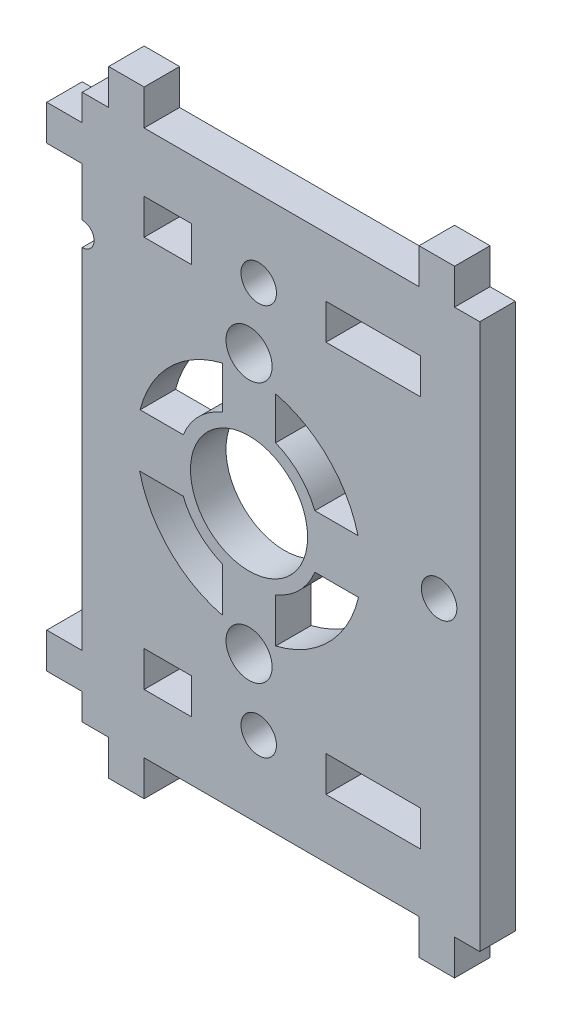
ISO-10303-21;
HEADER;
FILE_DESCRIPTION(('STEP AP214'),'2;1');
FILE_NAME('part.step','',(''),(''),'','','');
FILE_SCHEMA(('AUTOMOTIVE_DESIGN { 1 0 10303 214 1 1 1 1 }'));
ENDSEC;
DATA;
#1=APPLICATION_CONTEXT('core data for automotive mechanical design processes');
#2=APPLICATION_PROTOCOL_DEFINITION('international standard','automotive_design',2000,#1);
#3=PRODUCT_CONTEXT('',#1,'mechanical');
#4=PRODUCT('Part','Part','',(#3));
#5=PRODUCT_RELATED_PRODUCT_CATEGORY('part','',(#4));
#6=PRODUCT_DEFINITION_FORMATION('','',#4);
#7=PRODUCT_DEFINITION_CONTEXT('part definition',#1,'design');
#8=PRODUCT_DEFINITION('design','',#6,#7);
#9=PRODUCT_DEFINITION_SHAPE('','',#8);
#10=(LENGTH_UNIT() NAMED_UNIT(*) SI_UNIT(.MILLI.,.METRE.));
#11=(NAMED_UNIT(*) PLANE_ANGLE_UNIT() SI_UNIT($,.RADIAN.));
#12=(NAMED_UNIT(*) SI_UNIT($,.STERADIAN.) SOLID_ANGLE_UNIT());
#13=UNCERTAINTY_MEASURE_WITH_UNIT(LENGTH_MEASURE(1.E-05),#10,'distance_accuracy_value','');
#14=(GEOMETRIC_REPRESENTATION_CONTEXT(3) GLOBAL_UNCERTAINTY_ASSIGNED_CONTEXT((#13)) GLOBAL_UNIT_ASSIGNED_CONTEXT((#10,
#11,#12)) REPRESENTATION_CONTEXT('',''));
#15=CARTESIAN_POINT('',(0.,0.,0.));
#16=DIRECTION('',(0.,0.,1.));
#17=DIRECTION('',(1.,0.,0.));
#18=AXIS2_PLACEMENT_3D('',#15,#16,#17);
#19=CARTESIAN_POINT('',(0.,167.941147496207,3.));
#20=DIRECTION('',(0.,1.,0.));
#21=DIRECTION('',(0.,0.,1.));
#22=AXIS2_PLACEMENT_3D('',#19,#20,#21);
#23=PLANE('',#22);
#24=DIRECTION('',(1.,0.,0.));
#25=VECTOR('',#24,1.);
#26=CARTESIAN_POINT('',(0.,167.941147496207,0.));
#27=LINE('',#26,#25);
#28=CARTESIAN_POINT('',(13.4524830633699,167.941147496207,0.));
#29=VERTEX_POINT('',#28);
#30=CARTESIAN_POINT('',(17.4524830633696,167.941147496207,0.));
#31=VERTEX_POINT('',#30);
#32=EDGE_CURVE('E781',#29,#31,#27,.T.);
#33=ORIENTED_EDGE('',*,*,#32,.F.);
#34=DIRECTION('',(0.,0.,-1.));
#35=VECTOR('',#34,1.);
#36=CARTESIAN_POINT('',(13.4524830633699,167.941147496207,3.));
#37=LINE('',#36,#35);
#38=CARTESIAN_POINT('',(13.4524830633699,167.941147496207,3.));
#39=VERTEX_POINT('',#38);
#40=EDGE_CURVE('E11',#39,#29,#37,.T.);
#41=ORIENTED_EDGE('',*,*,#40,.F.);
#42=DIRECTION('',(1.,0.,0.));
#43=VECTOR('',#42,1.);
#44=CARTESIAN_POINT('',(0.,167.941147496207,3.));
#45=LINE('',#44,#43);
#46=CARTESIAN_POINT('',(17.4524830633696,167.941147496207,3.));
#47=VERTEX_POINT('',#46);
#48=EDGE_CURVE('E441',#39,#47,#45,.T.);
#49=ORIENTED_EDGE('',*,*,#48,.T.);
#50=DIRECTION('',(0.,0.,-1.));
#51=VECTOR('',#50,1.);
#52=CARTESIAN_POINT('',(17.4524830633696,167.941147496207,3.));
#53=LINE('',#52,#51);
#54=EDGE_CURVE('E51',#47,#31,#53,.T.);
#55=ORIENTED_EDGE('',*,*,#54,.T.);
#56=EDGE_LOOP('',(#33,#41,#49,#55));
#57=FACE_BOUND('',#56,.T.);
#58=ADVANCED_FACE('F32',(#57),#23,.T.);
#59=CARTESIAN_POINT('',(13.4524830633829,1.04235643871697E-12,3.));
#60=DIRECTION('',(-1.,0.,0.));
#61=DIRECTION('',(0.,-1.,0.));
#62=AXIS2_PLACEMENT_3D('',#59,#60,#61);
#63=PLANE('',#62);
#64=DIRECTION('',(0.,1.,0.));
#65=VECTOR('',#64,1.);
#66=CARTESIAN_POINT('',(13.4524830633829,1.04235643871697E-12,0.));
#67=LINE('',#66,#65);
#68=CARTESIAN_POINT('',(13.4524830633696,170.941147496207,0.));
#69=VERTEX_POINT('',#68);
#70=EDGE_CURVE('E446',#29,#69,#67,.T.);
#71=ORIENTED_EDGE('',*,*,#70,.T.);
#72=DIRECTION('',(0.,0.,-1.));
#73=VECTOR('',#72,1.);
#74=CARTESIAN_POINT('',(13.4524830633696,170.941147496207,3.));
#75=LINE('',#74,#73);
#76=CARTESIAN_POINT('',(13.4524830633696,170.941147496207,3.));
#77=VERTEX_POINT('',#76);
#78=EDGE_CURVE('E42',#77,#69,#75,.T.);
#79=ORIENTED_EDGE('',*,*,#78,.F.);
#80=DIRECTION('',(0.,1.,0.));
#81=VECTOR('',#80,1.);
#82=CARTESIAN_POINT('',(13.4524830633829,1.04235643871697E-12,3.));
#83=LINE('',#82,#81);
#84=EDGE_CURVE('E436',#39,#77,#83,.T.);
#85=ORIENTED_EDGE('',*,*,#84,.F.);
#86=ORIENTED_EDGE('',*,*,#40,.T.);
#87=EDGE_LOOP('',(#71,#79,#85,#86));
#88=FACE_BOUND('',#87,.T.);
#89=ADVANCED_FACE('F444',(#88),#63,.F.);
#90=CARTESIAN_POINT('',(0.,170.941147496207,3.));
#91=DIRECTION('',(0.,1.,0.));
#92=DIRECTION('',(0.,0.,1.));
#93=AXIS2_PLACEMENT_3D('',#90,#91,#92);
#94=PLANE('',#93);
#95=DIRECTION('',(1.,0.,0.));
#96=VECTOR('',#95,1.);
#97=CARTESIAN_POINT('',(0.,170.941147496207,0.));
#98=LINE('',#97,#96);
#99=CARTESIAN_POINT('',(17.4524830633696,170.941147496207,0.));
#100=VERTEX_POINT('',#99);
#101=EDGE_CURVE('E784',#69,#100,#98,.T.);
#102=ORIENTED_EDGE('',*,*,#101,.T.);
#103=DIRECTION('',(0.,0.,-1.));
#104=VECTOR('',#103,1.);
#105=CARTESIAN_POINT('',(17.4524830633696,170.941147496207,3.));
#106=LINE('',#105,#104);
#107=CARTESIAN_POINT('',(17.4524830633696,170.941147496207,3.));
#108=VERTEX_POINT('',#107);
#109=EDGE_CURVE('E239',#108,#100,#106,.T.);
#110=ORIENTED_EDGE('',*,*,#109,.F.);
#111=DIRECTION('',(1.,0.,0.));
#112=VECTOR('',#111,1.);
#113=CARTESIAN_POINT('',(0.,170.941147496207,3.));
#114=LINE('',#113,#112);
#115=EDGE_CURVE('E428',#77,#108,#114,.T.);
#116=ORIENTED_EDGE('',*,*,#115,.F.);
#117=ORIENTED_EDGE('',*,*,#78,.T.);
#118=EDGE_LOOP('',(#102,#110,#116,#117));
#119=FACE_BOUND('',#118,.T.);
#120=ADVANCED_FACE('F430',(#119),#94,.F.);
#121=CARTESIAN_POINT('',(0.,167.941147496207,3.));
#122=DIRECTION('',(0.,1.,0.));
#123=DIRECTION('',(0.,0.,1.));
#124=AXIS2_PLACEMENT_3D('',#121,#122,#123);
#125=PLANE('',#124);
#126=DIRECTION('',(1.,0.,0.));
#127=VECTOR('',#126,1.);
#128=CARTESIAN_POINT('',(0.,167.941147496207,0.));
#129=LINE('',#128,#127);
#130=CARTESIAN_POINT('',(28.8205985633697,167.941147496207,0.));
#131=VERTEX_POINT('',#130);
#132=CARTESIAN_POINT('',(36.8205985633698,167.941147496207,0.));
#133=VERTEX_POINT('',#132);
#134=EDGE_CURVE('E769',#131,#133,#129,.T.);
#135=ORIENTED_EDGE('',*,*,#134,.F.);
#136=DIRECTION('',(0.,0.,-1.));
#137=VECTOR('',#136,1.);
#138=CARTESIAN_POINT('',(28.8205985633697,167.941147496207,3.));
#139=LINE('',#138,#137);
#140=CARTESIAN_POINT('',(28.8205985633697,167.941147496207,3.));
#141=VERTEX_POINT('',#140);
#142=EDGE_CURVE('E459',#141,#131,#139,.T.);
#143=ORIENTED_EDGE('',*,*,#142,.F.);
#144=DIRECTION('',(1.,0.,0.));
#145=VECTOR('',#144,1.);
#146=CARTESIAN_POINT('',(0.,167.941147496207,3.));
#147=LINE('',#146,#145);
#148=CARTESIAN_POINT('',(36.8205985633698,167.941147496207,3.));
#149=VERTEX_POINT('',#148);
#150=EDGE_CURVE('E956',#141,#149,#147,.T.);
#151=ORIENTED_EDGE('',*,*,#150,.T.);
#152=DIRECTION('',(0.,0.,-1.));
#153=VECTOR('',#152,1.);
#154=CARTESIAN_POINT('',(36.8205985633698,167.941147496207,3.));
#155=LINE('',#154,#153);
#156=EDGE_CURVE('E451',#149,#133,#155,.T.);
#157=ORIENTED_EDGE('',*,*,#156,.T.);
#158=EDGE_LOOP('',(#135,#143,#151,#157));
#159=FACE_BOUND('',#158,.T.);
#160=ADVANCED_FACE('F1005',(#159),#125,.T.);
#161=CARTESIAN_POINT('',(28.8205985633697,0.,3.));
#162=DIRECTION('',(-1.,0.,0.));
#163=DIRECTION('',(0.,0.,1.));
#164=AXIS2_PLACEMENT_3D('',#161,#162,#163);
#165=PLANE('',#164);
#166=DIRECTION('',(0.,1.,0.));
#167=VECTOR('',#166,1.);
#168=CARTESIAN_POINT('',(28.8205985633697,0.,0.));
#169=LINE('',#168,#167);
#170=CARTESIAN_POINT('',(28.8205985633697,170.941147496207,0.));
#171=VERTEX_POINT('',#170);
#172=EDGE_CURVE('E772',#131,#171,#169,.T.);
#173=ORIENTED_EDGE('',*,*,#172,.T.);
#174=DIRECTION('',(0.,0.,-1.));
#175=VECTOR('',#174,1.);
#176=CARTESIAN_POINT('',(28.8205985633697,170.941147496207,3.));
#177=LINE('',#176,#175);
#178=CARTESIAN_POINT('',(28.8205985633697,170.941147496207,3.));
#179=VERTEX_POINT('',#178);
#180=EDGE_CURVE('E456',#179,#171,#177,.T.);
#181=ORIENTED_EDGE('',*,*,#180,.F.);
#182=DIRECTION('',(0.,1.,0.));
#183=VECTOR('',#182,1.);
#184=CARTESIAN_POINT('',(28.8205985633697,0.,3.));
#185=LINE('',#184,#183);
#186=EDGE_CURVE('E959',#141,#179,#185,.T.);
#187=ORIENTED_EDGE('',*,*,#186,.F.);
#188=ORIENTED_EDGE('',*,*,#142,.T.);
#189=EDGE_LOOP('',(#173,#181,#187,#188));
#190=FACE_BOUND('',#189,.T.);
#191=ADVANCED_FACE('F1001',(#190),#165,.F.);
#192=CARTESIAN_POINT('',(0.,170.941147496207,3.));
#193=DIRECTION('',(0.,1.,0.));
#194=DIRECTION('',(0.,0.,1.));
#195=AXIS2_PLACEMENT_3D('',#192,#193,#194);
#196=PLANE('',#195);
#197=DIRECTION('',(1.,0.,0.));
#198=VECTOR('',#197,1.);
#199=CARTESIAN_POINT('',(0.,170.941147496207,0.));
#200=LINE('',#199,#198);
#201=CARTESIAN_POINT('',(36.8205985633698,170.941147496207,0.));
#202=VERTEX_POINT('',#201);
#203=EDGE_CURVE('E775',#171,#202,#200,.T.);
#204=ORIENTED_EDGE('',*,*,#203,.T.);
#205=DIRECTION('',(0.,0.,-1.));
#206=VECTOR('',#205,1.);
#207=CARTESIAN_POINT('',(36.8205985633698,170.941147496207,3.));
#208=LINE('',#207,#206);
#209=CARTESIAN_POINT('',(36.8205985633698,170.941147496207,3.));
#210=VERTEX_POINT('',#209);
#211=EDGE_CURVE('E453',#210,#202,#208,.T.);
#212=ORIENTED_EDGE('',*,*,#211,.F.);
#213=DIRECTION('',(1.,0.,0.));
#214=VECTOR('',#213,1.);
#215=CARTESIAN_POINT('',(0.,170.941147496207,3.));
#216=LINE('',#215,#214);
#217=EDGE_CURVE('E962',#179,#210,#216,.T.);
#218=ORIENTED_EDGE('',*,*,#217,.F.);
#219=ORIENTED_EDGE('',*,*,#180,.T.);
#220=EDGE_LOOP('',(#204,#212,#218,#219));
#221=FACE_BOUND('',#220,.T.);
#222=ADVANCED_FACE('F997',(#221),#196,.F.);
#223=CARTESIAN_POINT('',(28.8205985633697,0.,3.));
#224=DIRECTION('',(1.,0.,0.));
#225=DIRECTION('',(0.,0.,-1.));
#226=AXIS2_PLACEMENT_3D('',#223,#224,#225);
#227=PLANE('',#226);
#228=DIRECTION('',(0.,-1.,0.));
#229=VECTOR('',#228,1.);
#230=CARTESIAN_POINT('',(28.8205985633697,0.,0.));
#231=LINE('',#230,#229);
#232=CARTESIAN_POINT('',(28.8205985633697,204.041147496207,0.));
#233=VERTEX_POINT('',#232);
#234=CARTESIAN_POINT('',(28.8205985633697,201.041147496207,0.));
#235=VERTEX_POINT('',#234);
#236=EDGE_CURVE('E757',#233,#235,#231,.T.);
#237=ORIENTED_EDGE('',*,*,#236,.F.);
#238=DIRECTION('',(0.,0.,-1.));
#239=VECTOR('',#238,1.);
#240=CARTESIAN_POINT('',(28.8205985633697,204.041147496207,3.));
#241=LINE('',#240,#239);
#242=CARTESIAN_POINT('',(28.8205985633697,204.041147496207,3.));
#243=VERTEX_POINT('',#242);
#244=EDGE_CURVE('E454',#243,#233,#241,.T.);
#245=ORIENTED_EDGE('',*,*,#244,.F.);
#246=DIRECTION('',(0.,-1.,0.));
#247=VECTOR('',#246,1.);
#248=CARTESIAN_POINT('',(28.8205985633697,0.,3.));
#249=LINE('',#248,#247);
#250=CARTESIAN_POINT('',(28.8205985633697,201.041147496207,3.));
#251=VERTEX_POINT('',#250);
#252=EDGE_CURVE('E945',#243,#251,#249,.T.);
#253=ORIENTED_EDGE('',*,*,#252,.T.);
#254=DIRECTION('',(0.,0.,-1.));
#255=VECTOR('',#254,1.);
#256=CARTESIAN_POINT('',(28.8205985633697,201.041147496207,3.));
#257=LINE('',#256,#255);
#258=EDGE_CURVE('E461',#251,#235,#257,.T.);
#259=ORIENTED_EDGE('',*,*,#258,.T.);
#260=EDGE_LOOP('',(#237,#245,#253,#259));
#261=FACE_BOUND('',#260,.T.);
#262=ADVANCED_FACE('F1000',(#261),#227,.T.);
#263=CARTESIAN_POINT('',(0.,204.041147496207,3.));
#264=DIRECTION('',(0.,1.,0.));
#265=DIRECTION('',(0.,0.,1.));
#266=AXIS2_PLACEMENT_3D('',#263,#264,#265);
#267=PLANE('',#266);
#268=DIRECTION('',(1.,0.,0.));
#269=VECTOR('',#268,1.);
#270=CARTESIAN_POINT('',(0.,204.041147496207,0.));
#271=LINE('',#270,#269);
#272=CARTESIAN_POINT('',(36.8205985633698,204.041147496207,0.));
#273=VERTEX_POINT('',#272);
#274=EDGE_CURVE('E760',#233,#273,#271,.T.);
#275=ORIENTED_EDGE('',*,*,#274,.T.);
#276=DIRECTION('',(0.,0.,-1.));
#277=VECTOR('',#276,1.);
#278=CARTESIAN_POINT('',(36.8205985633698,204.041147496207,3.));
#279=LINE('',#278,#277);
#280=CARTESIAN_POINT('',(36.8205985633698,204.041147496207,3.));
#281=VERTEX_POINT('',#280);
#282=EDGE_CURVE('E466',#281,#273,#279,.T.);
#283=ORIENTED_EDGE('',*,*,#282,.F.);
#284=DIRECTION('',(1.,0.,0.));
#285=VECTOR('',#284,1.);
#286=CARTESIAN_POINT('',(0.,204.041147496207,3.));
#287=LINE('',#286,#285);
#288=EDGE_CURVE('E948',#243,#281,#287,.T.);
#289=ORIENTED_EDGE('',*,*,#288,.F.);
#290=ORIENTED_EDGE('',*,*,#244,.T.);
#291=EDGE_LOOP('',(#275,#283,#289,#290));
#292=FACE_BOUND('',#291,.T.);
#293=ADVANCED_FACE('F1018',(#292),#267,.F.);
#294=CARTESIAN_POINT('',(36.8205985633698,0.,3.));
#295=DIRECTION('',(1.,0.,0.));
#296=DIRECTION('',(0.,0.,-1.));
#297=AXIS2_PLACEMENT_3D('',#294,#295,#296);
#298=PLANE('',#297);
#299=DIRECTION('',(0.,-1.,0.));
#300=VECTOR('',#299,1.);
#301=CARTESIAN_POINT('',(36.8205985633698,0.,0.));
#302=LINE('',#301,#300);
#303=CARTESIAN_POINT('',(36.8205985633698,201.041147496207,0.));
#304=VERTEX_POINT('',#303);
#305=EDGE_CURVE('E763',#273,#304,#302,.T.);
#306=ORIENTED_EDGE('',*,*,#305,.T.);
#307=DIRECTION('',(0.,0.,-1.));
#308=VECTOR('',#307,1.);
#309=CARTESIAN_POINT('',(36.8205985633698,201.041147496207,3.));
#310=LINE('',#309,#308);
#311=CARTESIAN_POINT('',(36.8205985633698,201.041147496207,3.));
#312=VERTEX_POINT('',#311);
#313=EDGE_CURVE('E463',#312,#304,#310,.T.);
#314=ORIENTED_EDGE('',*,*,#313,.F.);
#315=DIRECTION('',(0.,-1.,0.));
#316=VECTOR('',#315,1.);
#317=CARTESIAN_POINT('',(36.8205985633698,0.,3.));
#318=LINE('',#317,#316);
#319=EDGE_CURVE('E951',#281,#312,#318,.T.);
#320=ORIENTED_EDGE('',*,*,#319,.F.);
#321=ORIENTED_EDGE('',*,*,#282,.T.);
#322=EDGE_LOOP('',(#306,#314,#320,#321));
#323=FACE_BOUND('',#322,.T.);
#324=ADVANCED_FACE('F1014',(#323),#298,.F.);
#325=CARTESIAN_POINT('',(13.4524830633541,-1.04235643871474E-12,3.));
#326=DIRECTION('',(1.,0.,0.));
#327=DIRECTION('',(0.,1.,0.));
#328=AXIS2_PLACEMENT_3D('',#325,#326,#327);
#329=PLANE('',#328);
#330=DIRECTION('',(0.,-1.,0.));
#331=VECTOR('',#330,1.);
#332=CARTESIAN_POINT('',(13.4524830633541,-1.04235643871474E-12,0.));
#333=LINE('',#332,#331);
#334=CARTESIAN_POINT('',(13.4524830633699,204.041147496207,0.));
#335=VERTEX_POINT('',#334);
#336=CARTESIAN_POINT('',(13.4524830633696,201.041147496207,0.));
#337=VERTEX_POINT('',#336);
#338=EDGE_CURVE('E745',#335,#337,#333,.T.);
#339=ORIENTED_EDGE('',*,*,#338,.F.);
#340=DIRECTION('',(0.,0.,-1.));
#341=VECTOR('',#340,1.);
#342=CARTESIAN_POINT('',(13.4524830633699,204.041147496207,3.));
#343=LINE('',#342,#341);
#344=CARTESIAN_POINT('',(13.4524830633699,204.041147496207,3.));
#345=VERTEX_POINT('',#344);
#346=EDGE_CURVE('E464',#345,#335,#343,.T.);
#347=ORIENTED_EDGE('',*,*,#346,.F.);
#348=DIRECTION('',(0.,-1.,0.));
#349=VECTOR('',#348,1.);
#350=CARTESIAN_POINT('',(13.4524830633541,-1.04235643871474E-12,3.));
#351=LINE('',#350,#349);
#352=CARTESIAN_POINT('',(13.4524830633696,201.041147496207,3.));
#353=VERTEX_POINT('',#352);
#354=EDGE_CURVE('E934',#345,#353,#351,.T.);
#355=ORIENTED_EDGE('',*,*,#354,.T.);
#356=DIRECTION('',(0.,0.,-1.));
#357=VECTOR('',#356,1.);
#358=CARTESIAN_POINT('',(13.4524830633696,201.041147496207,3.));
#359=LINE('',#358,#357);
#360=EDGE_CURVE('E470',#353,#337,#359,.T.);
#361=ORIENTED_EDGE('',*,*,#360,.T.);
#362=EDGE_LOOP('',(#339,#347,#355,#361));
#363=FACE_BOUND('',#362,.T.);
#364=ADVANCED_FACE('F1017',(#363),#329,.T.);
#365=CARTESIAN_POINT('',(0.,204.041147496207,3.));
#366=DIRECTION('',(0.,1.,0.));
#367=DIRECTION('',(0.,0.,1.));
#368=AXIS2_PLACEMENT_3D('',#365,#366,#367);
#369=PLANE('',#368);
#370=DIRECTION('',(1.,0.,0.));
#371=VECTOR('',#370,1.);
#372=CARTESIAN_POINT('',(0.,204.041147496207,0.));
#373=LINE('',#372,#371);
#374=CARTESIAN_POINT('',(17.4524830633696,204.041147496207,0.));
#375=VERTEX_POINT('',#374);
#376=EDGE_CURVE('E748',#335,#375,#373,.T.);
#377=ORIENTED_EDGE('',*,*,#376,.T.);
#378=DIRECTION('',(0.,0.,-1.));
#379=VECTOR('',#378,1.);
#380=CARTESIAN_POINT('',(17.4524830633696,204.041147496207,3.));
#381=LINE('',#380,#379);
#382=CARTESIAN_POINT('',(17.4524830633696,204.041147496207,3.));
#383=VERTEX_POINT('',#382);
#384=EDGE_CURVE('E475',#383,#375,#381,.T.);
#385=ORIENTED_EDGE('',*,*,#384,.F.);
#386=DIRECTION('',(1.,0.,0.));
#387=VECTOR('',#386,1.);
#388=CARTESIAN_POINT('',(0.,204.041147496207,3.));
#389=LINE('',#388,#387);
#390=EDGE_CURVE('E937',#345,#383,#389,.T.);
#391=ORIENTED_EDGE('',*,*,#390,.F.);
#392=ORIENTED_EDGE('',*,*,#346,.T.);
#393=EDGE_LOOP('',(#377,#385,#391,#392));
#394=FACE_BOUND('',#393,.T.);
#395=ADVANCED_FACE('F1034',(#394),#369,.F.);
#396=CARTESIAN_POINT('',(17.4524830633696,0.,3.));
#397=DIRECTION('',(1.,0.,0.));
#398=DIRECTION('',(0.,0.,-1.));
#399=AXIS2_PLACEMENT_3D('',#396,#397,#398);
#400=PLANE('',#399);
#401=DIRECTION('',(0.,-1.,0.));
#402=VECTOR('',#401,1.);
#403=CARTESIAN_POINT('',(17.4524830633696,0.,0.));
#404=LINE('',#403,#402);
#405=CARTESIAN_POINT('',(17.4524830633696,201.041147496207,0.));
#406=VERTEX_POINT('',#405);
#407=EDGE_CURVE('E751',#375,#406,#404,.T.);
#408=ORIENTED_EDGE('',*,*,#407,.T.);
#409=DIRECTION('',(0.,0.,-1.));
#410=VECTOR('',#409,1.);
#411=CARTESIAN_POINT('',(17.4524830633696,201.041147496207,3.));
#412=LINE('',#411,#410);
#413=CARTESIAN_POINT('',(17.4524830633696,201.041147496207,3.));
#414=VERTEX_POINT('',#413);
#415=EDGE_CURVE('E472',#414,#406,#412,.T.);
#416=ORIENTED_EDGE('',*,*,#415,.F.);
#417=DIRECTION('',(0.,-1.,0.));
#418=VECTOR('',#417,1.);
#419=CARTESIAN_POINT('',(17.4524830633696,0.,3.));
#420=LINE('',#419,#418);
#421=EDGE_CURVE('E940',#383,#414,#420,.T.);
#422=ORIENTED_EDGE('',*,*,#421,.F.);
#423=ORIENTED_EDGE('',*,*,#384,.T.);
#424=EDGE_LOOP('',(#408,#416,#422,#423));
#425=FACE_BOUND('',#424,.T.);
#426=ADVANCED_FACE('F1030',(#425),#400,.F.);
#427=CARTESIAN_POINT('',(22.3205637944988,185.91071304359,3.));
#428=DIRECTION('',(0.,0.,-1.));
#429=DIRECTION('',(-1.,0.,0.));
#430=AXIS2_PLACEMENT_3D('',#427,#428,#429);
#431=CYLINDRICAL_SURFACE('',#430,9.50000000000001);
#432=CARTESIAN_POINT('',(22.3205637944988,185.91071304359,0.));
#433=DIRECTION('',(0.,0.,1.));
#434=DIRECTION('',(1.,0.,0.));
#435=AXIS2_PLACEMENT_3D('',#432,#433,#434);
#436=CIRCLE('',#435,9.50000000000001);
#437=CARTESIAN_POINT('',(20.070563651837,195.140420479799,0.));
#438=VERTEX_POINT('',#437);
#439=CARTESIAN_POINT('',(13.1108364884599,188.241147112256,0.));
#440=VERTEX_POINT('',#439);
#441=EDGE_CURVE('E724',#438,#440,#436,.T.);
#442=ORIENTED_EDGE('',*,*,#441,.F.);
#443=DIRECTION('',(0.,0.,-1.));
#444=VECTOR('',#443,1.);
#445=CARTESIAN_POINT('',(20.070563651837,195.140420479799,3.));
#446=LINE('',#445,#444);
#447=CARTESIAN_POINT('',(20.070563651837,195.140420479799,3.));
#448=VERTEX_POINT('',#447);
#449=EDGE_CURVE('E473',#448,#438,#446,.T.);
#450=ORIENTED_EDGE('',*,*,#449,.F.);
#451=CARTESIAN_POINT('',(22.3205637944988,185.91071304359,3.));
#452=DIRECTION('',(0.,0.,1.));
#453=DIRECTION('',(1.,0.,0.));
#454=AXIS2_PLACEMENT_3D('',#451,#452,#453);
#455=CIRCLE('',#454,9.50000000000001);
#456=CARTESIAN_POINT('',(13.1108364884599,188.241147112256,3.));
#457=VERTEX_POINT('',#456);
#458=EDGE_CURVE('E914',#448,#457,#455,.T.);
#459=ORIENTED_EDGE('',*,*,#458,.T.);
#460=DIRECTION('',(0.,0.,-1.));
#461=VECTOR('',#460,1.);
#462=CARTESIAN_POINT('',(13.1108364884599,188.241147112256,3.));
#463=LINE('',#462,#461);
#464=EDGE_CURVE('E479',#457,#440,#463,.T.);
#465=ORIENTED_EDGE('',*,*,#464,.T.);
#466=EDGE_LOOP('',(#442,#450,#459,#465));
#467=FACE_BOUND('',#466,.T.);
#468=ADVANCED_FACE('F1033',(#467),#431,.F.);
#469=CARTESIAN_POINT('',(20.070566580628,3.01231772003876E-07,3.));
#470=DIRECTION('',(1.,1.50086332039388E-08,0.));
#471=DIRECTION('',(-1.50086332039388E-08,1.,0.));
#472=AXIS2_PLACEMENT_3D('',#469,#470,#471);
#473=PLANE('',#472);
#474=DIRECTION('',(1.50086332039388E-08,-1.,0.));
#475=VECTOR('',#474,1.);
#476=CARTESIAN_POINT('',(20.070566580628,3.01231772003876E-07,0.));
#477=LINE('',#476,#475);
#478=CARTESIAN_POINT('',(20.0705637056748,191.55329636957,0.));
#479=VERTEX_POINT('',#478);
#480=EDGE_CURVE('E727',#438,#479,#477,.T.);
#481=ORIENTED_EDGE('',*,*,#480,.T.);
#482=DIRECTION('',(0.,0.,-1.));
#483=VECTOR('',#482,1.);
#484=CARTESIAN_POINT('',(20.0705637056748,191.55329636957,3.));
#485=LINE('',#484,#483);
#486=CARTESIAN_POINT('',(20.0705637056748,191.55329636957,3.));
#487=VERTEX_POINT('',#486);
#488=EDGE_CURVE('E484',#487,#479,#485,.T.);
#489=ORIENTED_EDGE('',*,*,#488,.F.);
#490=DIRECTION('',(1.50086332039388E-08,-1.,0.));
#491=VECTOR('',#490,1.);
#492=CARTESIAN_POINT('',(20.070566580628,3.01231772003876E-07,3.));
#493=LINE('',#492,#491);
#494=EDGE_CURVE('E917',#448,#487,#493,.T.);
#495=ORIENTED_EDGE('',*,*,#494,.F.);
#496=ORIENTED_EDGE('',*,*,#449,.T.);
#497=EDGE_LOOP('',(#481,#489,#495,#496));
#498=FACE_BOUND('',#497,.T.);
#499=ADVANCED_FACE('F1062',(#498),#473,.F.);
#500=CARTESIAN_POINT('',(22.3205636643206,185.9911474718,3.));
#501=DIRECTION('',(0.,0.,-1.));
#502=DIRECTION('',(-1.,0.,0.));
#503=AXIS2_PLACEMENT_3D('',#500,#501,#502);
#504=CYLINDRICAL_SURFACE('',#503,6.00000001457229);
#505=CARTESIAN_POINT('',(22.3205636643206,185.9911474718,0.));
#506=DIRECTION('',(0.,0.,1.));
#507=DIRECTION('',(1.,0.,0.));
#508=AXIS2_PLACEMENT_3D('',#505,#506,#507);
#509=CIRCLE('',#508,6.00000001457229);
#510=CARTESIAN_POINT('',(16.7584147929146,188.241147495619,0.));
#511=VERTEX_POINT('',#510);
#512=EDGE_CURVE('E730',#479,#511,#509,.T.);
#513=ORIENTED_EDGE('',*,*,#512,.T.);
#514=DIRECTION('',(0.,0.,-1.));
#515=VECTOR('',#514,1.);
#516=CARTESIAN_POINT('',(16.7584147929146,188.241147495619,3.));
#517=LINE('',#516,#515);
#518=CARTESIAN_POINT('',(16.7584147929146,188.241147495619,3.));
#519=VERTEX_POINT('',#518);
#520=EDGE_CURVE('E481',#519,#511,#517,.T.);
#521=ORIENTED_EDGE('',*,*,#520,.F.);
#522=CARTESIAN_POINT('',(22.3205636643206,185.9911474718,3.));
#523=DIRECTION('',(0.,0.,1.));
#524=DIRECTION('',(1.,0.,0.));
#525=AXIS2_PLACEMENT_3D('',#522,#523,#524);
#526=CIRCLE('',#525,6.00000001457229);
#527=EDGE_CURVE('E920',#487,#519,#526,.T.);
#528=ORIENTED_EDGE('',*,*,#527,.F.);
#529=ORIENTED_EDGE('',*,*,#488,.T.);
#530=EDGE_LOOP('',(#513,#521,#528,#529));
#531=FACE_BOUND('',#530,.T.);
#532=ADVANCED_FACE('F1058',(#531),#504,.T.);
#533=CARTESIAN_POINT('',(22.3205637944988,185.91071304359,3.));
#534=DIRECTION('',(0.,0.,-1.));
#535=DIRECTION('',(-1.,0.,0.));
#536=AXIS2_PLACEMENT_3D('',#533,#534,#535);
#537=CYLINDRICAL_SURFACE('',#536,9.50000019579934);
#538=CARTESIAN_POINT('',(22.3205637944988,185.91071304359,0.));
#539=DIRECTION('',(0.,0.,1.));
#540=DIRECTION('',(1.,0.,0.));
#541=AXIS2_PLACEMENT_3D('',#538,#539,#540);
#542=CIRCLE('',#541,9.50000019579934);
#543=CARTESIAN_POINT('',(13.071618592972,183.741147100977,0.));
#544=VERTEX_POINT('',#543);
#545=CARTESIAN_POINT('',(20.0705636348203,176.681005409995,0.));
#546=VERTEX_POINT('',#545);
#547=EDGE_CURVE('E712',#544,#546,#542,.T.);
#548=ORIENTED_EDGE('',*,*,#547,.F.);
#549=DIRECTION('',(0.,0.,-1.));
#550=VECTOR('',#549,1.);
#551=CARTESIAN_POINT('',(13.071618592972,183.741147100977,3.));
#552=LINE('',#551,#550);
#553=CARTESIAN_POINT('',(13.071618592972,183.741147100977,3.));
#554=VERTEX_POINT('',#553);
#555=EDGE_CURVE('E482',#554,#544,#552,.T.);
#556=ORIENTED_EDGE('',*,*,#555,.F.);
#557=CARTESIAN_POINT('',(22.3205637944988,185.91071304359,3.));
#558=DIRECTION('',(0.,0.,1.));
#559=DIRECTION('',(1.,0.,0.));
#560=AXIS2_PLACEMENT_3D('',#557,#558,#559);
#561=CIRCLE('',#560,9.50000019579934);
#562=CARTESIAN_POINT('',(20.0705636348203,176.681005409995,3.));
#563=VERTEX_POINT('',#562);
#564=EDGE_CURVE('E903',#554,#563,#561,.T.);
#565=ORIENTED_EDGE('',*,*,#564,.T.);
#566=DIRECTION('',(0.,0.,-1.));
#567=VECTOR('',#566,1.);
#568=CARTESIAN_POINT('',(20.0705636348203,176.681005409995,3.));
#569=LINE('',#568,#567);
#570=EDGE_CURVE('E488',#563,#546,#569,.T.);
#571=ORIENTED_EDGE('',*,*,#570,.T.);
#572=EDGE_LOOP('',(#548,#556,#565,#571));
#573=FACE_BOUND('',#572,.T.);
#574=ADVANCED_FACE('F1061',(#573),#537,.F.);
#575=CARTESIAN_POINT('',(-1.96973206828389E-05,183.741145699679,3.));
#576=DIRECTION('',(-1.07201468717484E-07,0.999999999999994,0.));
#577=DIRECTION('',(-0.999999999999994,-1.07201468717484E-07,0.));
#578=AXIS2_PLACEMENT_3D('',#575,#576,#577);
#579=PLANE('',#578);
#580=DIRECTION('',(0.999999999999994,1.07201468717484E-07,0.));
#581=VECTOR('',#580,1.);
#582=CARTESIAN_POINT('',(-1.96973206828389E-05,183.741145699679,0.));
#583=LINE('',#582,#581);
#584=CARTESIAN_POINT('',(16.7584147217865,183.741147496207,0.));
#585=VERTEX_POINT('',#584);
#586=EDGE_CURVE('E715',#544,#585,#583,.T.);
#587=ORIENTED_EDGE('',*,*,#586,.T.);
#588=DIRECTION('',(0.,0.,-1.));
#589=VECTOR('',#588,1.);
#590=CARTESIAN_POINT('',(16.7584147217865,183.741147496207,3.));
#591=LINE('',#590,#589);
#592=CARTESIAN_POINT('',(16.7584147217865,183.741147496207,3.));
#593=VERTEX_POINT('',#592);
#594=EDGE_CURVE('E494',#593,#585,#591,.T.);
#595=ORIENTED_EDGE('',*,*,#594,.F.);
#596=DIRECTION('',(0.999999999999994,1.07201468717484E-07,0.));
#597=VECTOR('',#596,1.);
#598=CARTESIAN_POINT('',(-1.96973206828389E-05,183.741145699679,3.));
#599=LINE('',#598,#597);
#600=EDGE_CURVE('E906',#554,#593,#599,.T.);
#601=ORIENTED_EDGE('',*,*,#600,.F.);
#602=ORIENTED_EDGE('',*,*,#555,.T.);
#603=EDGE_LOOP('',(#587,#595,#601,#602));
#604=FACE_BOUND('',#603,.T.);
#605=ADVANCED_FACE('F1078',(#604),#579,.F.);
#606=CARTESIAN_POINT('',(22.3205636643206,185.9911474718,3.));
#607=DIRECTION('',(0.,0.,-1.));
#608=DIRECTION('',(-1.,0.,0.));
#609=AXIS2_PLACEMENT_3D('',#606,#607,#608);
#610=CYLINDRICAL_SURFACE('',#609,6.00000006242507);
#611=CARTESIAN_POINT('',(22.3205636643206,185.9911474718,0.));
#612=DIRECTION('',(0.,0.,1.));
#613=DIRECTION('',(1.,0.,0.));
#614=AXIS2_PLACEMENT_3D('',#611,#612,#613);
#615=CIRCLE('',#614,6.00000006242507);
#616=CARTESIAN_POINT('',(20.0705636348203,180.428998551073,0.));
#617=VERTEX_POINT('',#616);
#618=EDGE_CURVE('E718',#585,#617,#615,.T.);
#619=ORIENTED_EDGE('',*,*,#618,.T.);
#620=DIRECTION('',(0.,0.,-1.));
#621=VECTOR('',#620,1.);
#622=CARTESIAN_POINT('',(20.0705636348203,180.428998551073,3.));
#623=LINE('',#622,#621);
#624=CARTESIAN_POINT('',(20.0705636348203,180.428998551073,3.));
#625=VERTEX_POINT('',#624);
#626=EDGE_CURVE('E490',#625,#617,#623,.T.);
#627=ORIENTED_EDGE('',*,*,#626,.F.);
#628=CARTESIAN_POINT('',(22.3205636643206,185.9911474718,3.));
#629=DIRECTION('',(0.,0.,1.));
#630=DIRECTION('',(1.,0.,0.));
#631=AXIS2_PLACEMENT_3D('',#628,#629,#630);
#632=CIRCLE('',#631,6.00000006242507);
#633=EDGE_CURVE('E909',#593,#625,#632,.T.);
#634=ORIENTED_EDGE('',*,*,#633,.F.);
#635=ORIENTED_EDGE('',*,*,#594,.T.);
#636=EDGE_LOOP('',(#619,#627,#634,#635));
#637=FACE_BOUND('',#636,.T.);
#638=ADVANCED_FACE('F1074',(#637),#610,.T.);
#639=CARTESIAN_POINT('',(22.3205637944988,185.91071304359,3.));
#640=DIRECTION('',(0.,0.,-1.));
#641=DIRECTION('',(-1.,0.,0.));
#642=AXIS2_PLACEMENT_3D('',#639,#640,#641);
#643=CYLINDRICAL_SURFACE('',#642,9.50000002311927);
#644=CARTESIAN_POINT('',(22.3205637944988,185.91071304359,0.));
#645=DIRECTION('',(0.,0.,1.));
#646=DIRECTION('',(1.,0.,0.));
#647=AXIS2_PLACEMENT_3D('',#644,#645,#646);
#648=CIRCLE('',#647,9.50000002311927);
#649=CARTESIAN_POINT('',(24.5705636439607,176.681005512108,0.));
#650=VERTEX_POINT('',#649);
#651=CARTESIAN_POINT('',(31.5695088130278,183.741147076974,0.));
#652=VERTEX_POINT('',#651);
#653=EDGE_CURVE('E700',#650,#652,#648,.T.);
#654=ORIENTED_EDGE('',*,*,#653,.F.);
#655=DIRECTION('',(0.,0.,-1.));
#656=VECTOR('',#655,1.);
#657=CARTESIAN_POINT('',(24.5705636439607,176.681005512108,3.));
#658=LINE('',#657,#656);
#659=CARTESIAN_POINT('',(24.5705636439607,176.681005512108,3.));
#660=VERTEX_POINT('',#659);
#661=EDGE_CURVE('E491',#660,#650,#658,.T.);
#662=ORIENTED_EDGE('',*,*,#661,.F.);
#663=CARTESIAN_POINT('',(22.3205637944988,185.91071304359,3.));
#664=DIRECTION('',(0.,0.,1.));
#665=DIRECTION('',(1.,0.,0.));
#666=AXIS2_PLACEMENT_3D('',#663,#664,#665);
#667=CIRCLE('',#666,9.50000002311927);
#668=CARTESIAN_POINT('',(31.5695088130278,183.741147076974,3.));
#669=VERTEX_POINT('',#668);
#670=EDGE_CURVE('E892',#660,#669,#667,.T.);
#671=ORIENTED_EDGE('',*,*,#670,.T.);
#672=DIRECTION('',(0.,0.,-1.));
#673=VECTOR('',#672,1.);
#674=CARTESIAN_POINT('',(31.5695088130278,183.741147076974,3.));
#675=LINE('',#674,#673);
#676=EDGE_CURVE('E498',#669,#652,#675,.T.);
#677=ORIENTED_EDGE('',*,*,#676,.T.);
#678=EDGE_LOOP('',(#654,#662,#671,#677));
#679=FACE_BOUND('',#678,.T.);
#680=ADVANCED_FACE('F1077',(#679),#643,.F.);
#681=CARTESIAN_POINT('',(24.5705636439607,0.,3.));
#682=DIRECTION('',(1.,0.,0.));
#683=DIRECTION('',(0.,0.,-1.));
#684=AXIS2_PLACEMENT_3D('',#681,#682,#683);
#685=PLANE('',#684);
#686=DIRECTION('',(0.,-1.,0.));
#687=VECTOR('',#686,1.);
#688=CARTESIAN_POINT('',(24.5705636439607,0.,0.));
#689=LINE('',#688,#687);
#690=CARTESIAN_POINT('',(24.5705636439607,180.428998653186,0.));
#691=VERTEX_POINT('',#690);
#692=EDGE_CURVE('E703',#691,#650,#689,.T.);
#693=ORIENTED_EDGE('',*,*,#692,.F.);
#694=DIRECTION('',(0.,0.,-1.));
#695=VECTOR('',#694,1.);
#696=CARTESIAN_POINT('',(24.5705636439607,180.428998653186,3.));
#697=LINE('',#696,#695);
#698=CARTESIAN_POINT('',(24.5705636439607,180.428998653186,3.));
#699=VERTEX_POINT('',#698);
#700=EDGE_CURVE('E504',#699,#691,#697,.T.);
#701=ORIENTED_EDGE('',*,*,#700,.F.);
#702=DIRECTION('',(0.,-1.,0.));
#703=VECTOR('',#702,1.);
#704=CARTESIAN_POINT('',(24.5705636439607,0.,3.));
#705=LINE('',#704,#703);
#706=EDGE_CURVE('E895',#699,#660,#705,.T.);
#707=ORIENTED_EDGE('',*,*,#706,.T.);
#708=ORIENTED_EDGE('',*,*,#661,.T.);
#709=EDGE_LOOP('',(#693,#701,#707,#708));
#710=FACE_BOUND('',#709,.T.);
#711=ADVANCED_FACE('F1094',(#710),#685,.T.);
#712=CARTESIAN_POINT('',(22.3205636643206,185.9911474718,3.));
#713=DIRECTION('',(0.,0.,-1.));
#714=DIRECTION('',(-1.,0.,0.));
#715=AXIS2_PLACEMENT_3D('',#712,#713,#714);
#716=CYLINDRICAL_SURFACE('',#715,5.99999994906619);
#717=CARTESIAN_POINT('',(22.3205636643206,185.9911474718,0.));
#718=DIRECTION('',(0.,0.,1.));
#719=DIRECTION('',(1.,0.,0.));
#720=AXIS2_PLACEMENT_3D('',#717,#718,#719);
#721=CIRCLE('',#720,5.99999994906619);
#722=CARTESIAN_POINT('',(27.8827124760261,183.741147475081,0.));
#723=VERTEX_POINT('',#722);
#724=EDGE_CURVE('E706',#691,#723,#721,.T.);
#725=ORIENTED_EDGE('',*,*,#724,.T.);
#726=DIRECTION('',(0.,0.,-1.));
#727=VECTOR('',#726,1.);
#728=CARTESIAN_POINT('',(27.8827124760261,183.741147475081,3.));
#729=LINE('',#728,#727);
#730=CARTESIAN_POINT('',(27.8827124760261,183.741147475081,3.));
#731=VERTEX_POINT('',#730);
#732=EDGE_CURVE('E500',#731,#723,#729,.T.);
#733=ORIENTED_EDGE('',*,*,#732,.F.);
#734=CARTESIAN_POINT('',(22.3205636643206,185.9911474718,3.));
#735=DIRECTION('',(0.,0.,1.));
#736=DIRECTION('',(1.,0.,0.));
#737=AXIS2_PLACEMENT_3D('',#734,#735,#736);
#738=CIRCLE('',#737,5.99999994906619);
#739=EDGE_CURVE('E898',#699,#731,#738,.T.);
#740=ORIENTED_EDGE('',*,*,#739,.F.);
#741=ORIENTED_EDGE('',*,*,#700,.T.);
#742=EDGE_LOOP('',(#725,#733,#740,#741));
#743=FACE_BOUND('',#742,.T.);
#744=ADVANCED_FACE('F1090',(#743),#716,.T.);
#745=CARTESIAN_POINT('',(22.3205637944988,185.91071304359,3.));
#746=DIRECTION('',(0.,0.,-1.));
#747=DIRECTION('',(-1.,0.,0.));
#748=AXIS2_PLACEMENT_3D('',#745,#746,#747);
#749=CYLINDRICAL_SURFACE('',#748,9.49999953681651);
#750=CARTESIAN_POINT('',(22.3205637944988,185.91071304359,0.));
#751=DIRECTION('',(0.,0.,1.));
#752=DIRECTION('',(1.,0.,0.));
#753=AXIS2_PLACEMENT_3D('',#750,#751,#752);
#754=CIRCLE('',#753,9.49999953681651);
#755=CARTESIAN_POINT('',(31.5302905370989,188.241147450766,0.));
#756=VERTEX_POINT('',#755);
#757=CARTESIAN_POINT('',(24.570563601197,195.140420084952,0.));
#758=VERTEX_POINT('',#757);
#759=EDGE_CURVE('E688',#756,#758,#754,.T.);
#760=ORIENTED_EDGE('',*,*,#759,.F.);
#761=DIRECTION('',(0.,0.,-1.));
#762=VECTOR('',#761,1.);
#763=CARTESIAN_POINT('',(31.5302905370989,188.241147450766,3.));
#764=LINE('',#763,#762);
#765=CARTESIAN_POINT('',(31.5302905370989,188.241147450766,3.));
#766=VERTEX_POINT('',#765);
#767=EDGE_CURVE('E501',#766,#756,#764,.T.);
#768=ORIENTED_EDGE('',*,*,#767,.F.);
#769=CARTESIAN_POINT('',(22.3205637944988,185.91071304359,3.));
#770=DIRECTION('',(0.,0.,1.));
#771=DIRECTION('',(1.,0.,0.));
#772=AXIS2_PLACEMENT_3D('',#769,#770,#771);
#773=CIRCLE('',#772,9.49999953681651);
#774=CARTESIAN_POINT('',(24.570563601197,195.140420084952,3.));
#775=VERTEX_POINT('',#774);
#776=EDGE_CURVE('E881',#766,#775,#773,.T.);
#777=ORIENTED_EDGE('',*,*,#776,.T.);
#778=DIRECTION('',(0.,0.,-1.));
#779=VECTOR('',#778,1.);
#780=CARTESIAN_POINT('',(24.570563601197,195.140420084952,3.));
#781=LINE('',#780,#779);
#782=EDGE_CURVE('E507',#775,#758,#781,.T.);
#783=ORIENTED_EDGE('',*,*,#782,.T.);
#784=EDGE_LOOP('',(#760,#768,#777,#783));
#785=FACE_BOUND('',#784,.T.);
#786=ADVANCED_FACE('F1093',(#785),#749,.F.);
#787=CARTESIAN_POINT('',(3.53543786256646E-06,188.241148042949,3.));
#788=DIRECTION('',(1.87814295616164E-08,1.,0.));
#789=DIRECTION('',(-1.,1.87814295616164E-08,0.));
#790=AXIS2_PLACEMENT_3D('',#787,#788,#789);
#791=PLANE('',#790);
#792=DIRECTION('',(1.,-1.87814295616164E-08,0.));
#793=VECTOR('',#792,1.);
#794=CARTESIAN_POINT('',(3.53543786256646E-06,188.241148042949,0.));
#795=LINE('',#794,#793);
#796=CARTESIAN_POINT('',(27.8827126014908,188.241147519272,0.));
#797=VERTEX_POINT('',#796);
#798=EDGE_CURVE('E691',#797,#756,#795,.T.);
#799=ORIENTED_EDGE('',*,*,#798,.F.);
#800=DIRECTION('',(0.,0.,-1.));
#801=VECTOR('',#800,1.);
#802=CARTESIAN_POINT('',(27.8827126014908,188.241147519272,3.));
#803=LINE('',#802,#801);
#804=CARTESIAN_POINT('',(27.8827126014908,188.241147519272,3.));
#805=VERTEX_POINT('',#804);
#806=EDGE_CURVE('E511',#805,#797,#803,.T.);
#807=ORIENTED_EDGE('',*,*,#806,.F.);
#808=DIRECTION('',(1.,-1.87814295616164E-08,0.));
#809=VECTOR('',#808,1.);
#810=CARTESIAN_POINT('',(3.53543786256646E-06,188.241148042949,3.));
#811=LINE('',#810,#809);
#812=EDGE_CURVE('E884',#805,#766,#811,.T.);
#813=ORIENTED_EDGE('',*,*,#812,.T.);
#814=ORIENTED_EDGE('',*,*,#767,.T.);
#815=EDGE_LOOP('',(#799,#807,#813,#814));
#816=FACE_BOUND('',#815,.T.);
#817=ADVANCED_FACE('F1109',(#816),#791,.T.);
#818=CARTESIAN_POINT('',(22.3205636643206,185.9911474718,3.));
#819=DIRECTION('',(0.,0.,-1.));
#820=DIRECTION('',(-1.,0.,0.));
#821=AXIS2_PLACEMENT_3D('',#818,#819,#820);
#822=CYLINDRICAL_SURFACE('',#821,6.00000008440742);
#823=CARTESIAN_POINT('',(22.3205636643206,185.9911474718,0.));
#824=DIRECTION('',(0.,0.,1.));
#825=DIRECTION('',(1.,0.,0.));
#826=AXIS2_PLACEMENT_3D('',#823,#824,#825);
#827=CIRCLE('',#826,6.00000008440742);
#828=CARTESIAN_POINT('',(24.570563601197,191.553296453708,0.));
#829=VERTEX_POINT('',#828);
#830=EDGE_CURVE('E694',#797,#829,#827,.T.);
#831=ORIENTED_EDGE('',*,*,#830,.T.);
#832=DIRECTION('',(0.,0.,-1.));
#833=VECTOR('',#832,1.);
#834=CARTESIAN_POINT('',(24.570563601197,191.553296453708,3.));
#835=LINE('',#834,#833);
#836=CARTESIAN_POINT('',(24.570563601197,191.553296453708,3.));
#837=VERTEX_POINT('',#836);
#838=EDGE_CURVE('E509',#837,#829,#835,.T.);
#839=ORIENTED_EDGE('',*,*,#838,.F.);
#840=CARTESIAN_POINT('',(22.3205636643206,185.9911474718,3.));
#841=DIRECTION('',(0.,0.,1.));
#842=DIRECTION('',(1.,0.,0.));
#843=AXIS2_PLACEMENT_3D('',#840,#841,#842);
#844=CIRCLE('',#843,6.00000008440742);
#845=EDGE_CURVE('E887',#805,#837,#844,.T.);
#846=ORIENTED_EDGE('',*,*,#845,.F.);
#847=ORIENTED_EDGE('',*,*,#806,.T.);
#848=EDGE_LOOP('',(#831,#839,#846,#847));
#849=FACE_BOUND('',#848,.T.);
#850=ADVANCED_FACE('F1106',(#849),#822,.T.);
#851=CARTESIAN_POINT('',(8.22059906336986,198.677028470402,3.));
#852=DIRECTION('',(0.,0.,-1.));
#853=DIRECTION('',(-1.,0.,0.));
#854=AXIS2_PLACEMENT_3D('',#851,#852,#853);
#855=CYLINDRICAL_SURFACE('',#854,1.);
#856=CARTESIAN_POINT('',(8.22059906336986,198.677028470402,0.));
#857=DIRECTION('',(0.,0.,1.));
#858=DIRECTION('',(1.,0.,0.));
#859=AXIS2_PLACEMENT_3D('',#856,#857,#858);
#860=CIRCLE('',#859,1.);
#861=CARTESIAN_POINT('',(8.22059906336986,197.677028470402,0.));
#862=VERTEX_POINT('',#861);
#863=CARTESIAN_POINT('',(8.22059906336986,199.677028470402,0.));
#864=VERTEX_POINT('',#863);
#865=EDGE_CURVE('E588',#862,#864,#860,.T.);
#866=ORIENTED_EDGE('',*,*,#865,.F.);
#867=DIRECTION('',(0.,0.,-1.));
#868=VECTOR('',#867,1.);
#869=CARTESIAN_POINT('',(8.22059906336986,197.677028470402,3.));
#870=LINE('',#869,#868);
#871=CARTESIAN_POINT('',(8.22059906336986,197.677028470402,3.));
#872=VERTEX_POINT('',#871);
#873=EDGE_CURVE('E36',#872,#862,#870,.T.);
#874=ORIENTED_EDGE('',*,*,#873,.F.);
#875=CARTESIAN_POINT('',(8.22059906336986,198.677028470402,3.));
#876=DIRECTION('',(0.,0.,1.));
#877=DIRECTION('',(1.,0.,0.));
#878=AXIS2_PLACEMENT_3D('',#875,#876,#877);
#879=CIRCLE('',#878,1.);
#880=CARTESIAN_POINT('',(8.22059906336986,199.677028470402,3.));
#881=VERTEX_POINT('',#880);
#882=EDGE_CURVE('E791',#872,#881,#879,.T.);
#883=ORIENTED_EDGE('',*,*,#882,.T.);
#884=DIRECTION('',(0.,0.,-1.));
#885=VECTOR('',#884,1.);
#886=CARTESIAN_POINT('',(8.22059906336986,199.677028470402,3.));
#887=LINE('',#886,#885);
#888=EDGE_CURVE('E514',#881,#864,#887,.T.);
#889=ORIENTED_EDGE('',*,*,#888,.T.);
#890=EDGE_LOOP('',(#866,#874,#883,#889));
#891=FACE_BOUND('',#890,.T.);
#892=ADVANCED_FACE('F589',(#891),#855,.F.);
#893=CARTESIAN_POINT('',(8.22059906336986,0.,3.));
#894=DIRECTION('',(-1.,0.,0.));
#895=DIRECTION('',(0.,0.,1.));
#896=AXIS2_PLACEMENT_3D('',#893,#894,#895);
#897=PLANE('',#896);
#898=DIRECTION('',(0.,1.,0.));
#899=VECTOR('',#898,1.);
#900=CARTESIAN_POINT('',(8.22059906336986,0.,0.));
#901=LINE('',#900,#899);
#902=CARTESIAN_POINT('',(8.22059906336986,168.173047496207,0.));
#903=VERTEX_POINT('',#902);
#904=EDGE_CURVE('E584',#903,#862,#901,.T.);
#905=ORIENTED_EDGE('',*,*,#904,.F.);
#906=DIRECTION('',(0.,0.,-1.));
#907=VECTOR('',#906,1.);
#908=CARTESIAN_POINT('',(8.22059906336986,168.173047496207,3.));
#909=LINE('',#908,#907);
#910=CARTESIAN_POINT('',(8.22059906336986,168.173047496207,3.));
#911=VERTEX_POINT('',#910);
#912=EDGE_CURVE('E574',#911,#903,#909,.T.);
#913=ORIENTED_EDGE('',*,*,#912,.F.);
#914=DIRECTION('',(0.,1.,0.));
#915=VECTOR('',#914,1.);
#916=CARTESIAN_POINT('',(8.22059906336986,0.,3.));
#917=LINE('',#916,#915);
#918=EDGE_CURVE('E586',#911,#872,#917,.T.);
#919=ORIENTED_EDGE('',*,*,#918,.T.);
#920=ORIENTED_EDGE('',*,*,#873,.T.);
#921=EDGE_LOOP('',(#905,#913,#919,#920));
#922=FACE_BOUND('',#921,.T.);
#923=ADVANCED_FACE('F582',(#922),#897,.T.);
#924=CARTESIAN_POINT('',(0.,168.173047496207,3.));
#925=DIRECTION('',(0.,-1.,0.));
#926=DIRECTION('',(0.,0.,-1.));
#927=AXIS2_PLACEMENT_3D('',#924,#925,#926);
#928=PLANE('',#927);
#929=DIRECTION('',(-1.,0.,0.));
#930=VECTOR('',#929,1.);
#931=CARTESIAN_POINT('',(0.,168.173047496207,0.));
#932=LINE('',#931,#930);
#933=CARTESIAN_POINT('',(5.2205990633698,168.173047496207,0.));
#934=VERTEX_POINT('',#933);
#935=EDGE_CURVE('E597',#903,#934,#932,.T.);
#936=ORIENTED_EDGE('',*,*,#935,.T.);
#937=DIRECTION('',(0.,0.,-1.));
#938=VECTOR('',#937,1.);
#939=CARTESIAN_POINT('',(5.2205990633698,168.173047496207,3.));
#940=LINE('',#939,#938);
#941=CARTESIAN_POINT('',(5.2205990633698,168.173047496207,3.));
#942=VERTEX_POINT('',#941);
#943=EDGE_CURVE('E572',#942,#934,#940,.T.);
#944=ORIENTED_EDGE('',*,*,#943,.F.);
#945=DIRECTION('',(-1.,0.,0.));
#946=VECTOR('',#945,1.);
#947=CARTESIAN_POINT('',(0.,168.173047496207,3.));
#948=LINE('',#947,#946);
#949=EDGE_CURVE('E798',#911,#942,#948,.T.);
#950=ORIENTED_EDGE('',*,*,#949,.F.);
#951=ORIENTED_EDGE('',*,*,#912,.T.);
#952=EDGE_LOOP('',(#936,#944,#950,#951));
#953=FACE_BOUND('',#952,.T.);
#954=ADVANCED_FACE('F1225',(#953),#928,.F.);
#955=CARTESIAN_POINT('',(5.22059906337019,0.,3.));
#956=DIRECTION('',(1.,0.,0.));
#957=DIRECTION('',(0.,1.,0.));
#958=AXIS2_PLACEMENT_3D('',#955,#956,#957);
#959=PLANE('',#958);
#960=DIRECTION('',(0.,-1.,0.));
#961=VECTOR('',#960,1.);
#962=CARTESIAN_POINT('',(5.22059906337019,0.,0.));
#963=LINE('',#962,#961);
#964=CARTESIAN_POINT('',(5.22059906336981,165.173047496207,0.));
#965=VERTEX_POINT('',#964);
#966=EDGE_CURVE('E599',#934,#965,#963,.T.);
#967=ORIENTED_EDGE('',*,*,#966,.T.);
#968=DIRECTION('',(0.,0.,-1.));
#969=VECTOR('',#968,1.);
#970=CARTESIAN_POINT('',(5.22059906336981,165.173047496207,3.));
#971=LINE('',#970,#969);
#972=CARTESIAN_POINT('',(5.22059906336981,165.173047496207,3.));
#973=VERTEX_POINT('',#972);
#974=EDGE_CURVE('E570',#973,#965,#971,.T.);
#975=ORIENTED_EDGE('',*,*,#974,.F.);
#976=DIRECTION('',(0.,-1.,0.));
#977=VECTOR('',#976,1.);
#978=CARTESIAN_POINT('',(5.22059906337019,0.,3.));
#979=LINE('',#978,#977);
#980=EDGE_CURVE('E801',#942,#973,#979,.T.);
#981=ORIENTED_EDGE('',*,*,#980,.F.);
#982=ORIENTED_EDGE('',*,*,#943,.T.);
#983=EDGE_LOOP('',(#967,#975,#981,#982));
#984=FACE_BOUND('',#983,.T.);
#985=ADVANCED_FACE('F1221',(#984),#959,.F.);
#986=CARTESIAN_POINT('',(0.,165.173047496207,3.));
#987=DIRECTION('',(0.,-1.,0.));
#988=DIRECTION('',(0.,0.,-1.));
#989=AXIS2_PLACEMENT_3D('',#986,#987,#988);
#990=PLANE('',#989);
#991=DIRECTION('',(-1.,0.,0.));
#992=VECTOR('',#991,1.);
#993=CARTESIAN_POINT('',(0.,165.173047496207,0.));
#994=LINE('',#993,#992);
#995=CARTESIAN_POINT('',(8.22059906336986,165.173047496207,0.));
#996=VERTEX_POINT('',#995);
#997=EDGE_CURVE('E605',#996,#965,#994,.T.);
#998=ORIENTED_EDGE('',*,*,#997,.F.);
#999=DIRECTION('',(0.,0.,-1.));
#1000=VECTOR('',#999,1.);
#1001=CARTESIAN_POINT('',(8.22059906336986,165.173047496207,3.));
#1002=LINE('',#1001,#1000);
#1003=CARTESIAN_POINT('',(8.22059906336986,165.173047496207,3.));
#1004=VERTEX_POINT('',#1003);
#1005=EDGE_CURVE('E568',#1004,#996,#1002,.T.);
#1006=ORIENTED_EDGE('',*,*,#1005,.F.);
#1007=DIRECTION('',(-1.,0.,0.));
#1008=VECTOR('',#1007,1.);
#1009=CARTESIAN_POINT('',(0.,165.173047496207,3.));
#1010=LINE('',#1009,#1008);
#1011=EDGE_CURVE('E803',#1004,#973,#1010,.T.);
#1012=ORIENTED_EDGE('',*,*,#1011,.T.);
#1013=ORIENTED_EDGE('',*,*,#974,.T.);
#1014=EDGE_LOOP('',(#998,#1006,#1012,#1013));
#1015=FACE_BOUND('',#1014,.T.);
#1016=ADVANCED_FACE('F1217',(#1015),#990,.T.);
#1017=CARTESIAN_POINT('',(8.22059906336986,0.,3.));
#1018=DIRECTION('',(-1.,0.,0.));
#1019=DIRECTION('',(0.,0.,1.));
#1020=AXIS2_PLACEMENT_3D('',#1017,#1018,#1019);
#1021=PLANE('',#1020);
#1022=DIRECTION('',(0.,1.,0.));
#1023=VECTOR('',#1022,1.);
#1024=CARTESIAN_POINT('',(8.22059906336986,0.,0.));
#1025=LINE('',#1024,#1023);
#1026=CARTESIAN_POINT('',(8.22059906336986,162.941147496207,0.));
#1027=VERTEX_POINT('',#1026);
#1028=EDGE_CURVE('E608',#1027,#996,#1025,.T.);
#1029=ORIENTED_EDGE('',*,*,#1028,.F.);
#1030=DIRECTION('',(0.,0.,-1.));
#1031=VECTOR('',#1030,1.);
#1032=CARTESIAN_POINT('',(8.22059906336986,162.941147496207,3.));
#1033=LINE('',#1032,#1031);
#1034=CARTESIAN_POINT('',(8.22059906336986,162.941147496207,3.));
#1035=VERTEX_POINT('',#1034);
#1036=EDGE_CURVE('E566',#1035,#1027,#1033,.T.);
#1037=ORIENTED_EDGE('',*,*,#1036,.F.);
#1038=DIRECTION('',(0.,1.,0.));
#1039=VECTOR('',#1038,1.);
#1040=CARTESIAN_POINT('',(8.22059906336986,0.,3.));
#1041=LINE('',#1040,#1039);
#1042=EDGE_CURVE('E806',#1035,#1004,#1041,.T.);
#1043=ORIENTED_EDGE('',*,*,#1042,.T.);
#1044=ORIENTED_EDGE('',*,*,#1005,.T.);
#1045=EDGE_LOOP('',(#1029,#1037,#1043,#1044));
#1046=FACE_BOUND('',#1045,.T.);
#1047=ADVANCED_FACE('F1213',(#1046),#1021,.T.);
#1048=CARTESIAN_POINT('',(0.,162.941147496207,3.));
#1049=DIRECTION('',(0.,1.,0.));
#1050=DIRECTION('',(0.,0.,1.));
#1051=AXIS2_PLACEMENT_3D('',#1048,#1049,#1050);
#1052=PLANE('',#1051);
#1053=DIRECTION('',(1.,0.,0.));
#1054=VECTOR('',#1053,1.);
#1055=CARTESIAN_POINT('',(0.,162.941147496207,0.));
#1056=LINE('',#1055,#1054);
#1057=CARTESIAN_POINT('',(10.4524830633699,162.941147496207,0.));
#1058=VERTEX_POINT('',#1057);
#1059=EDGE_CURVE('E611',#1027,#1058,#1056,.T.);
#1060=ORIENTED_EDGE('',*,*,#1059,.T.);
#1061=DIRECTION('',(0.,0.,-1.));
#1062=VECTOR('',#1061,1.);
#1063=CARTESIAN_POINT('',(10.4524830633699,162.941147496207,3.));
#1064=LINE('',#1063,#1062);
#1065=CARTESIAN_POINT('',(10.4524830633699,162.941147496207,3.));
#1066=VERTEX_POINT('',#1065);
#1067=EDGE_CURVE('E563',#1066,#1058,#1064,.T.);
#1068=ORIENTED_EDGE('',*,*,#1067,.F.);
#1069=DIRECTION('',(1.,0.,0.));
#1070=VECTOR('',#1069,1.);
#1071=CARTESIAN_POINT('',(0.,162.941147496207,3.));
#1072=LINE('',#1071,#1070);
#1073=EDGE_CURVE('E809',#1035,#1066,#1072,.T.);
#1074=ORIENTED_EDGE('',*,*,#1073,.F.);
#1075=ORIENTED_EDGE('',*,*,#1036,.T.);
#1076=EDGE_LOOP('',(#1060,#1068,#1074,#1075));
#1077=FACE_BOUND('',#1076,.T.);
#1078=ADVANCED_FACE('F1209',(#1077),#1052,.F.);
#1079=CARTESIAN_POINT('',(10.4524830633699,0.,3.));
#1080=DIRECTION('',(1.,0.,0.));
#1081=DIRECTION('',(0.,0.,-1.));
#1082=AXIS2_PLACEMENT_3D('',#1079,#1080,#1081);
#1083=PLANE('',#1082);
#1084=DIRECTION('',(0.,-1.,0.));
#1085=VECTOR('',#1084,1.);
#1086=CARTESIAN_POINT('',(10.4524830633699,0.,0.));
#1087=LINE('',#1086,#1085);
#1088=CARTESIAN_POINT('',(10.4524830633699,159.941147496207,0.));
#1089=VERTEX_POINT('',#1088);
#1090=EDGE_CURVE('E614',#1058,#1089,#1087,.T.);
#1091=ORIENTED_EDGE('',*,*,#1090,.T.);
#1092=DIRECTION('',(0.,0.,-1.));
#1093=VECTOR('',#1092,1.);
#1094=CARTESIAN_POINT('',(10.4524830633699,159.941147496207,3.));
#1095=LINE('',#1094,#1093);
#1096=CARTESIAN_POINT('',(10.4524830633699,159.941147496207,3.));
#1097=VERTEX_POINT('',#1096);
#1098=EDGE_CURVE('E560',#1097,#1089,#1095,.T.);
#1099=ORIENTED_EDGE('',*,*,#1098,.F.);
#1100=DIRECTION('',(0.,-1.,0.));
#1101=VECTOR('',#1100,1.);
#1102=CARTESIAN_POINT('',(10.4524830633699,0.,3.));
#1103=LINE('',#1102,#1101);
#1104=EDGE_CURVE('E812',#1066,#1097,#1103,.T.);
#1105=ORIENTED_EDGE('',*,*,#1104,.F.);
#1106=ORIENTED_EDGE('',*,*,#1067,.T.);
#1107=EDGE_LOOP('',(#1091,#1099,#1105,#1106));
#1108=FACE_BOUND('',#1107,.T.);
#1109=ADVANCED_FACE('F1205',(#1108),#1083,.F.);
#1110=CARTESIAN_POINT('',(0.,159.941147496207,3.));
#1111=DIRECTION('',(0.,1.,0.));
#1112=DIRECTION('',(0.,0.,1.));
#1113=AXIS2_PLACEMENT_3D('',#1110,#1111,#1112);
#1114=PLANE('',#1113);
#1115=DIRECTION('',(1.,0.,0.));
#1116=VECTOR('',#1115,1.);
#1117=CARTESIAN_POINT('',(0.,159.941147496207,0.));
#1118=LINE('',#1117,#1116);
#1119=CARTESIAN_POINT('',(13.4524830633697,159.941147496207,0.));
#1120=VERTEX_POINT('',#1119);
#1121=EDGE_CURVE('E617',#1089,#1120,#1118,.T.);
#1122=ORIENTED_EDGE('',*,*,#1121,.T.);
#1123=DIRECTION('',(0.,0.,-1.));
#1124=VECTOR('',#1123,1.);
#1125=CARTESIAN_POINT('',(13.4524830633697,159.941147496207,3.));
#1126=LINE('',#1125,#1124);
#1127=CARTESIAN_POINT('',(13.4524830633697,159.941147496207,3.));
#1128=VERTEX_POINT('',#1127);
#1129=EDGE_CURVE('E558',#1128,#1120,#1126,.T.);
#1130=ORIENTED_EDGE('',*,*,#1129,.F.);
#1131=DIRECTION('',(1.,0.,0.));
#1132=VECTOR('',#1131,1.);
#1133=CARTESIAN_POINT('',(0.,159.941147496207,3.));
#1134=LINE('',#1133,#1132);
#1135=EDGE_CURVE('E815',#1097,#1128,#1134,.T.);
#1136=ORIENTED_EDGE('',*,*,#1135,.F.);
#1137=ORIENTED_EDGE('',*,*,#1098,.T.);
#1138=EDGE_LOOP('',(#1122,#1130,#1136,#1137));
#1139=FACE_BOUND('',#1138,.T.);
#1140=ADVANCED_FACE('F1201',(#1139),#1114,.F.);
#1141=CARTESIAN_POINT('',(13.4524830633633,-5.44514557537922E-13,3.));
#1142=DIRECTION('',(1.,0.,0.));
#1143=DIRECTION('',(0.,1.,0.));
#1144=AXIS2_PLACEMENT_3D('',#1141,#1142,#1143);
#1145=PLANE('',#1144);
#1146=DIRECTION('',(0.,-1.,0.));
#1147=VECTOR('',#1146,1.);
#1148=CARTESIAN_POINT('',(13.4524830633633,-5.44514557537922E-13,0.));
#1149=LINE('',#1148,#1147);
#1150=CARTESIAN_POINT('',(13.4524830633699,162.941147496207,0.));
#1151=VERTEX_POINT('',#1150);
#1152=EDGE_CURVE('E620',#1151,#1120,#1149,.T.);
#1153=ORIENTED_EDGE('',*,*,#1152,.F.);
#1154=DIRECTION('',(0.,0.,-1.));
#1155=VECTOR('',#1154,1.);
#1156=CARTESIAN_POINT('',(13.4524830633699,162.941147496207,3.));
#1157=LINE('',#1156,#1155);
#1158=CARTESIAN_POINT('',(13.4524830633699,162.941147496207,3.));
#1159=VERTEX_POINT('',#1158);
#1160=EDGE_CURVE('E556',#1159,#1151,#1157,.T.);
#1161=ORIENTED_EDGE('',*,*,#1160,.F.);
#1162=DIRECTION('',(0.,-1.,0.));
#1163=VECTOR('',#1162,1.);
#1164=CARTESIAN_POINT('',(13.4524830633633,-5.44514557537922E-13,3.));
#1165=LINE('',#1164,#1163);
#1166=EDGE_CURVE('E817',#1159,#1128,#1165,.T.);
#1167=ORIENTED_EDGE('',*,*,#1166,.T.);
#1168=ORIENTED_EDGE('',*,*,#1129,.T.);
#1169=EDGE_LOOP('',(#1153,#1161,#1167,#1168));
#1170=FACE_BOUND('',#1169,.T.);
#1171=ADVANCED_FACE('F1197',(#1170),#1145,.T.);
#1172=CARTESIAN_POINT('',(0.,162.941147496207,3.));
#1173=DIRECTION('',(0.,1.,0.));
#1174=DIRECTION('',(0.,0.,1.));
#1175=AXIS2_PLACEMENT_3D('',#1172,#1173,#1174);
#1176=PLANE('',#1175);
#1177=DIRECTION('',(1.,0.,0.));
#1178=VECTOR('',#1177,1.);
#1179=CARTESIAN_POINT('',(0.,162.941147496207,0.));
#1180=LINE('',#1179,#1178);
#1181=CARTESIAN_POINT('',(36.6887135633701,162.941147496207,0.));
#1182=VERTEX_POINT('',#1181);
#1183=EDGE_CURVE('E623',#1151,#1182,#1180,.T.);
#1184=ORIENTED_EDGE('',*,*,#1183,.T.);
#1185=DIRECTION('',(0.,0.,-1.));
#1186=VECTOR('',#1185,1.);
#1187=CARTESIAN_POINT('',(36.6887135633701,162.941147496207,3.));
#1188=LINE('',#1187,#1186);
#1189=CARTESIAN_POINT('',(36.6887135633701,162.941147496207,3.));
#1190=VERTEX_POINT('',#1189);
#1191=EDGE_CURVE('E554',#1190,#1182,#1188,.T.);
#1192=ORIENTED_EDGE('',*,*,#1191,.F.);
#1193=DIRECTION('',(1.,0.,0.));
#1194=VECTOR('',#1193,1.);
#1195=CARTESIAN_POINT('',(0.,162.941147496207,3.));
#1196=LINE('',#1195,#1194);
#1197=EDGE_CURVE('E820',#1159,#1190,#1196,.T.);
#1198=ORIENTED_EDGE('',*,*,#1197,.F.);
#1199=ORIENTED_EDGE('',*,*,#1160,.T.);
#1200=EDGE_LOOP('',(#1184,#1192,#1198,#1199));
#1201=FACE_BOUND('',#1200,.T.);
#1202=ADVANCED_FACE('F1193',(#1201),#1176,.F.);
#1203=CARTESIAN_POINT('',(36.6887135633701,0.,3.));
#1204=DIRECTION('',(-1.,0.,0.));
#1205=DIRECTION('',(0.,0.,1.));
#1206=AXIS2_PLACEMENT_3D('',#1203,#1204,#1205);
#1207=PLANE('',#1206);
#1208=DIRECTION('',(0.,1.,0.));
#1209=VECTOR('',#1208,1.);
#1210=CARTESIAN_POINT('',(36.6887135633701,0.,0.));
#1211=LINE('',#1210,#1209);
#1212=CARTESIAN_POINT('',(36.6887135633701,159.941147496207,0.));
#1213=VERTEX_POINT('',#1212);
#1214=EDGE_CURVE('E626',#1213,#1182,#1211,.T.);
#1215=ORIENTED_EDGE('',*,*,#1214,.F.);
#1216=DIRECTION('',(0.,0.,-1.));
#1217=VECTOR('',#1216,1.);
#1218=CARTESIAN_POINT('',(36.6887135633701,159.941147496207,3.));
#1219=LINE('',#1218,#1217);
#1220=CARTESIAN_POINT('',(36.6887135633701,159.941147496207,3.));
#1221=VERTEX_POINT('',#1220);
#1222=EDGE_CURVE('E552',#1221,#1213,#1219,.T.);
#1223=ORIENTED_EDGE('',*,*,#1222,.F.);
#1224=DIRECTION('',(0.,1.,0.));
#1225=VECTOR('',#1224,1.);
#1226=CARTESIAN_POINT('',(36.6887135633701,0.,3.));
#1227=LINE('',#1226,#1225);
#1228=EDGE_CURVE('E822',#1221,#1190,#1227,.T.);
#1229=ORIENTED_EDGE('',*,*,#1228,.T.);
#1230=ORIENTED_EDGE('',*,*,#1191,.T.);
#1231=EDGE_LOOP('',(#1215,#1223,#1229,#1230));
#1232=FACE_BOUND('',#1231,.T.);
#1233=ADVANCED_FACE('F1189',(#1232),#1207,.T.);
#1234=CARTESIAN_POINT('',(0.,159.941147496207,3.));
#1235=DIRECTION('',(0.,1.,0.));
#1236=DIRECTION('',(0.,0.,1.));
#1237=AXIS2_PLACEMENT_3D('',#1234,#1235,#1236);
#1238=PLANE('',#1237);
#1239=DIRECTION('',(1.,0.,0.));
#1240=VECTOR('',#1239,1.);
#1241=CARTESIAN_POINT('',(0.,159.941147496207,0.));
#1242=LINE('',#1241,#1240);
#1243=CARTESIAN_POINT('',(39.68871356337,159.941147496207,0.));
#1244=VERTEX_POINT('',#1243);
#1245=EDGE_CURVE('E629',#1213,#1244,#1242,.T.);
#1246=ORIENTED_EDGE('',*,*,#1245,.T.);
#1247=DIRECTION('',(0.,0.,-1.));
#1248=VECTOR('',#1247,1.);
#1249=CARTESIAN_POINT('',(39.68871356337,159.941147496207,3.));
#1250=LINE('',#1249,#1248);
#1251=CARTESIAN_POINT('',(39.68871356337,159.941147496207,3.));
#1252=VERTEX_POINT('',#1251);
#1253=EDGE_CURVE('E549',#1252,#1244,#1250,.T.);
#1254=ORIENTED_EDGE('',*,*,#1253,.F.);
#1255=DIRECTION('',(1.,0.,0.));
#1256=VECTOR('',#1255,1.);
#1257=CARTESIAN_POINT('',(0.,159.941147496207,3.));
#1258=LINE('',#1257,#1256);
#1259=EDGE_CURVE('E825',#1221,#1252,#1258,.T.);
#1260=ORIENTED_EDGE('',*,*,#1259,.F.);
#1261=ORIENTED_EDGE('',*,*,#1222,.T.);
#1262=EDGE_LOOP('',(#1246,#1254,#1260,#1261));
#1263=FACE_BOUND('',#1262,.T.);
#1264=ADVANCED_FACE('F1185',(#1263),#1238,.F.);
#1265=CARTESIAN_POINT('',(39.688713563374,1.00978449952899E-12,3.));
#1266=DIRECTION('',(-1.,0.,0.));
#1267=DIRECTION('',(0.,-1.,0.));
#1268=AXIS2_PLACEMENT_3D('',#1265,#1266,#1267);
#1269=PLANE('',#1268);
#1270=DIRECTION('',(0.,1.,0.));
#1271=VECTOR('',#1270,1.);
#1272=CARTESIAN_POINT('',(39.688713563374,1.00978449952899E-12,0.));
#1273=LINE('',#1272,#1271);
#1274=CARTESIAN_POINT('',(39.6887135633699,162.941147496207,0.));
#1275=VERTEX_POINT('',#1274);
#1276=EDGE_CURVE('E632',#1244,#1275,#1273,.T.);
#1277=ORIENTED_EDGE('',*,*,#1276,.T.);
#1278=DIRECTION('',(0.,0.,-1.));
#1279=VECTOR('',#1278,1.);
#1280=CARTESIAN_POINT('',(39.6887135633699,162.941147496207,3.));
#1281=LINE('',#1280,#1279);
#1282=CARTESIAN_POINT('',(39.6887135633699,162.941147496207,3.));
#1283=VERTEX_POINT('',#1282);
#1284=EDGE_CURVE('E546',#1283,#1275,#1281,.T.);
#1285=ORIENTED_EDGE('',*,*,#1284,.F.);
#1286=DIRECTION('',(0.,1.,0.));
#1287=VECTOR('',#1286,1.);
#1288=CARTESIAN_POINT('',(39.688713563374,1.00978449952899E-12,3.));
#1289=LINE('',#1288,#1287);
#1290=EDGE_CURVE('E828',#1252,#1283,#1289,.T.);
#1291=ORIENTED_EDGE('',*,*,#1290,.F.);
#1292=ORIENTED_EDGE('',*,*,#1253,.T.);
#1293=EDGE_LOOP('',(#1277,#1285,#1291,#1292));
#1294=FACE_BOUND('',#1293,.T.);
#1295=ADVANCED_FACE('F1181',(#1294),#1269,.F.);
#1296=CARTESIAN_POINT('',(0.,162.941147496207,3.));
#1297=DIRECTION('',(0.,1.,0.));
#1298=DIRECTION('',(0.,0.,1.));
#1299=AXIS2_PLACEMENT_3D('',#1296,#1297,#1298);
#1300=PLANE('',#1299);
#1301=DIRECTION('',(1.,0.,0.));
#1302=VECTOR('',#1301,1.);
#1303=CARTESIAN_POINT('',(0.,162.941147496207,0.));
#1304=LINE('',#1303,#1302);
#1305=CARTESIAN_POINT('',(41.8205985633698,162.941147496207,0.));
#1306=VERTEX_POINT('',#1305);
#1307=EDGE_CURVE('E635',#1275,#1306,#1304,.T.);
#1308=ORIENTED_EDGE('',*,*,#1307,.T.);
#1309=DIRECTION('',(0.,0.,-1.));
#1310=VECTOR('',#1309,1.);
#1311=CARTESIAN_POINT('',(41.8205985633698,162.941147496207,3.));
#1312=LINE('',#1311,#1310);
#1313=CARTESIAN_POINT('',(41.8205985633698,162.941147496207,3.));
#1314=VERTEX_POINT('',#1313);
#1315=EDGE_CURVE('E544',#1314,#1306,#1312,.T.);
#1316=ORIENTED_EDGE('',*,*,#1315,.F.);
#1317=DIRECTION('',(1.,0.,0.));
#1318=VECTOR('',#1317,1.);
#1319=CARTESIAN_POINT('',(0.,162.941147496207,3.));
#1320=LINE('',#1319,#1318);
#1321=EDGE_CURVE('E831',#1283,#1314,#1320,.T.);
#1322=ORIENTED_EDGE('',*,*,#1321,.F.);
#1323=ORIENTED_EDGE('',*,*,#1284,.T.);
#1324=EDGE_LOOP('',(#1308,#1316,#1322,#1323));
#1325=FACE_BOUND('',#1324,.T.);
#1326=ADVANCED_FACE('F1177',(#1325),#1300,.F.);
#1327=CARTESIAN_POINT('',(41.8205985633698,0.,3.));
#1328=DIRECTION('',(1.,0.,0.));
#1329=DIRECTION('',(0.,0.,-1.));
#1330=AXIS2_PLACEMENT_3D('',#1327,#1328,#1329);
#1331=PLANE('',#1330);
#1332=DIRECTION('',(0.,-1.,0.));
#1333=VECTOR('',#1332,1.);
#1334=CARTESIAN_POINT('',(41.8205985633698,0.,0.));
#1335=LINE('',#1334,#1333);
#1336=CARTESIAN_POINT('',(41.8205985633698,209.041147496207,0.));
#1337=VERTEX_POINT('',#1336);
#1338=EDGE_CURVE('E638',#1337,#1306,#1335,.T.);
#1339=ORIENTED_EDGE('',*,*,#1338,.F.);
#1340=DIRECTION('',(0.,0.,-1.));
#1341=VECTOR('',#1340,1.);
#1342=CARTESIAN_POINT('',(41.8205985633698,209.041147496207,3.));
#1343=LINE('',#1342,#1341);
#1344=CARTESIAN_POINT('',(41.8205985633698,209.041147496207,3.));
#1345=VERTEX_POINT('',#1344);
#1346=EDGE_CURVE('E542',#1345,#1337,#1343,.T.);
#1347=ORIENTED_EDGE('',*,*,#1346,.F.);
#1348=DIRECTION('',(0.,-1.,0.));
#1349=VECTOR('',#1348,1.);
#1350=CARTESIAN_POINT('',(41.8205985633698,0.,3.));
#1351=LINE('',#1350,#1349);
#1352=EDGE_CURVE('E833',#1345,#1314,#1351,.T.);
#1353=ORIENTED_EDGE('',*,*,#1352,.T.);
#1354=ORIENTED_EDGE('',*,*,#1315,.T.);
#1355=EDGE_LOOP('',(#1339,#1347,#1353,#1354));
#1356=FACE_BOUND('',#1355,.T.);
#1357=ADVANCED_FACE('F1173',(#1356),#1331,.T.);
#1358=CARTESIAN_POINT('',(0.,209.041147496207,3.));
#1359=DIRECTION('',(0.,1.,0.));
#1360=DIRECTION('',(0.,0.,1.));
#1361=AXIS2_PLACEMENT_3D('',#1358,#1359,#1360);
#1362=PLANE('',#1361);
#1363=DIRECTION('',(1.,0.,0.));
#1364=VECTOR('',#1363,1.);
#1365=CARTESIAN_POINT('',(0.,209.041147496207,0.));
#1366=LINE('',#1365,#1364);
#1367=CARTESIAN_POINT('',(39.6887135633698,209.041147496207,0.));
#1368=VERTEX_POINT('',#1367);
#1369=EDGE_CURVE('E641',#1368,#1337,#1366,.T.);
#1370=ORIENTED_EDGE('',*,*,#1369,.F.);
#1371=DIRECTION('',(0.,0.,-1.));
#1372=VECTOR('',#1371,1.);
#1373=CARTESIAN_POINT('',(39.6887135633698,209.041147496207,3.));
#1374=LINE('',#1373,#1372);
#1375=CARTESIAN_POINT('',(39.6887135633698,209.041147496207,3.));
#1376=VERTEX_POINT('',#1375);
#1377=EDGE_CURVE('E540',#1376,#1368,#1374,.T.);
#1378=ORIENTED_EDGE('',*,*,#1377,.F.);
#1379=DIRECTION('',(1.,0.,0.));
#1380=VECTOR('',#1379,1.);
#1381=CARTESIAN_POINT('',(0.,209.041147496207,3.));
#1382=LINE('',#1381,#1380);
#1383=EDGE_CURVE('E836',#1376,#1345,#1382,.T.);
#1384=ORIENTED_EDGE('',*,*,#1383,.T.);
#1385=ORIENTED_EDGE('',*,*,#1346,.T.);
#1386=EDGE_LOOP('',(#1370,#1378,#1384,#1385));
#1387=FACE_BOUND('',#1386,.T.);
#1388=ADVANCED_FACE('F1169',(#1387),#1362,.T.);
#1389=CARTESIAN_POINT('',(39.6887135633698,0.,3.));
#1390=DIRECTION('',(1.,0.,0.));
#1391=DIRECTION('',(0.,0.,-1.));
#1392=AXIS2_PLACEMENT_3D('',#1389,#1390,#1391);
#1393=PLANE('',#1392);
#1394=DIRECTION('',(0.,-1.,0.));
#1395=VECTOR('',#1394,1.);
#1396=CARTESIAN_POINT('',(39.6887135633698,0.,0.));
#1397=LINE('',#1396,#1395);
#1398=CARTESIAN_POINT('',(39.6887135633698,212.041147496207,0.));
#1399=VERTEX_POINT('',#1398);
#1400=EDGE_CURVE('E644',#1399,#1368,#1397,.T.);
#1401=ORIENTED_EDGE('',*,*,#1400,.F.);
#1402=DIRECTION('',(0.,0.,-1.));
#1403=VECTOR('',#1402,1.);
#1404=CARTESIAN_POINT('',(39.6887135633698,212.041147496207,3.));
#1405=LINE('',#1404,#1403);
#1406=CARTESIAN_POINT('',(39.6887135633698,212.041147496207,3.));
#1407=VERTEX_POINT('',#1406);
#1408=EDGE_CURVE('E538',#1407,#1399,#1405,.T.);
#1409=ORIENTED_EDGE('',*,*,#1408,.F.);
#1410=DIRECTION('',(0.,-1.,0.));
#1411=VECTOR('',#1410,1.);
#1412=CARTESIAN_POINT('',(39.6887135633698,0.,3.));
#1413=LINE('',#1412,#1411);
#1414=EDGE_CURVE('E839',#1407,#1376,#1413,.T.);
#1415=ORIENTED_EDGE('',*,*,#1414,.T.);
#1416=ORIENTED_EDGE('',*,*,#1377,.T.);
#1417=EDGE_LOOP('',(#1401,#1409,#1415,#1416));
#1418=FACE_BOUND('',#1417,.T.);
#1419=ADVANCED_FACE('F1165',(#1418),#1393,.T.);
#1420=CARTESIAN_POINT('',(0.,212.041147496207,3.));
#1421=DIRECTION('',(0.,1.,0.));
#1422=DIRECTION('',(0.,0.,1.));
#1423=AXIS2_PLACEMENT_3D('',#1420,#1421,#1422);
#1424=PLANE('',#1423);
#1425=DIRECTION('',(1.,0.,0.));
#1426=VECTOR('',#1425,1.);
#1427=CARTESIAN_POINT('',(0.,212.041147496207,0.));
#1428=LINE('',#1427,#1426);
#1429=CARTESIAN_POINT('',(36.6887135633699,212.041147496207,0.));
#1430=VERTEX_POINT('',#1429);
#1431=EDGE_CURVE('E647',#1430,#1399,#1428,.T.);
#1432=ORIENTED_EDGE('',*,*,#1431,.F.);
#1433=DIRECTION('',(0.,0.,-1.));
#1434=VECTOR('',#1433,1.);
#1435=CARTESIAN_POINT('',(36.6887135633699,212.041147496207,3.));
#1436=LINE('',#1435,#1434);
#1437=CARTESIAN_POINT('',(36.6887135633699,212.041147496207,3.));
#1438=VERTEX_POINT('',#1437);
#1439=EDGE_CURVE('E536',#1438,#1430,#1436,.T.);
#1440=ORIENTED_EDGE('',*,*,#1439,.F.);
#1441=DIRECTION('',(1.,0.,0.));
#1442=VECTOR('',#1441,1.);
#1443=CARTESIAN_POINT('',(0.,212.041147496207,3.));
#1444=LINE('',#1443,#1442);
#1445=EDGE_CURVE('E842',#1438,#1407,#1444,.T.);
#1446=ORIENTED_EDGE('',*,*,#1445,.T.);
#1447=ORIENTED_EDGE('',*,*,#1408,.T.);
#1448=EDGE_LOOP('',(#1432,#1440,#1446,#1447));
#1449=FACE_BOUND('',#1448,.T.);
#1450=ADVANCED_FACE('F1161',(#1449),#1424,.T.);
#1451=CARTESIAN_POINT('',(36.6887135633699,0.,3.));
#1452=DIRECTION('',(1.,0.,0.));
#1453=DIRECTION('',(0.,0.,-1.));
#1454=AXIS2_PLACEMENT_3D('',#1451,#1452,#1453);
#1455=PLANE('',#1454);
#1456=DIRECTION('',(0.,-1.,0.));
#1457=VECTOR('',#1456,1.);
#1458=CARTESIAN_POINT('',(36.6887135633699,0.,0.));
#1459=LINE('',#1458,#1457);
#1460=CARTESIAN_POINT('',(36.6887135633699,209.041147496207,0.));
#1461=VERTEX_POINT('',#1460);
#1462=EDGE_CURVE('E650',#1430,#1461,#1459,.T.);
#1463=ORIENTED_EDGE('',*,*,#1462,.T.);
#1464=DIRECTION('',(0.,0.,-1.));
#1465=VECTOR('',#1464,1.);
#1466=CARTESIAN_POINT('',(36.6887135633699,209.041147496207,3.));
#1467=LINE('',#1466,#1465);
#1468=CARTESIAN_POINT('',(36.6887135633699,209.041147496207,3.));
#1469=VERTEX_POINT('',#1468);
#1470=EDGE_CURVE('E534',#1469,#1461,#1467,.T.);
#1471=ORIENTED_EDGE('',*,*,#1470,.F.);
#1472=DIRECTION('',(0.,-1.,0.));
#1473=VECTOR('',#1472,1.);
#1474=CARTESIAN_POINT('',(36.6887135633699,0.,3.));
#1475=LINE('',#1474,#1473);
#1476=EDGE_CURVE('E845',#1438,#1469,#1475,.T.);
#1477=ORIENTED_EDGE('',*,*,#1476,.F.);
#1478=ORIENTED_EDGE('',*,*,#1439,.T.);
#1479=EDGE_LOOP('',(#1463,#1471,#1477,#1478));
#1480=FACE_BOUND('',#1479,.T.);
#1481=ADVANCED_FACE('F1157',(#1480),#1455,.F.);
#1482=CARTESIAN_POINT('',(0.,209.041147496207,3.));
#1483=DIRECTION('',(0.,1.,0.));
#1484=DIRECTION('',(0.,0.,1.));
#1485=AXIS2_PLACEMENT_3D('',#1482,#1483,#1484);
#1486=PLANE('',#1485);
#1487=DIRECTION('',(1.,0.,0.));
#1488=VECTOR('',#1487,1.);
#1489=CARTESIAN_POINT('',(0.,209.041147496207,0.));
#1490=LINE('',#1489,#1488);
#1491=CARTESIAN_POINT('',(13.4524830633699,209.041147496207,0.));
#1492=VERTEX_POINT('',#1491);
#1493=EDGE_CURVE('E653',#1492,#1461,#1490,.T.);
#1494=ORIENTED_EDGE('',*,*,#1493,.F.);
#1495=DIRECTION('',(0.,0.,-1.));
#1496=VECTOR('',#1495,1.);
#1497=CARTESIAN_POINT('',(13.4524830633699,209.041147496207,3.));
#1498=LINE('',#1497,#1496);
#1499=CARTESIAN_POINT('',(13.4524830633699,209.041147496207,3.));
#1500=VERTEX_POINT('',#1499);
#1501=EDGE_CURVE('E532',#1500,#1492,#1498,.T.);
#1502=ORIENTED_EDGE('',*,*,#1501,.F.);
#1503=DIRECTION('',(1.,0.,0.));
#1504=VECTOR('',#1503,1.);
#1505=CARTESIAN_POINT('',(0.,209.041147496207,3.));
#1506=LINE('',#1505,#1504);
#1507=EDGE_CURVE('E847',#1500,#1469,#1506,.T.);
#1508=ORIENTED_EDGE('',*,*,#1507,.T.);
#1509=ORIENTED_EDGE('',*,*,#1470,.T.);
#1510=EDGE_LOOP('',(#1494,#1502,#1508,#1509));
#1511=FACE_BOUND('',#1510,.T.);
#1512=ADVANCED_FACE('F1153',(#1511),#1486,.T.);
#1513=CARTESIAN_POINT('',(13.4524830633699,0.,3.));
#1514=DIRECTION('',(-1.,0.,0.));
#1515=DIRECTION('',(0.,0.,1.));
#1516=AXIS2_PLACEMENT_3D('',#1513,#1514,#1515);
#1517=PLANE('',#1516);
#1518=DIRECTION('',(0.,1.,0.));
#1519=VECTOR('',#1518,1.);
#1520=CARTESIAN_POINT('',(13.4524830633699,0.,0.));
#1521=LINE('',#1520,#1519);
#1522=CARTESIAN_POINT('',(13.4524830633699,212.041147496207,0.));
#1523=VERTEX_POINT('',#1522);
#1524=EDGE_CURVE('E656',#1492,#1523,#1521,.T.);
#1525=ORIENTED_EDGE('',*,*,#1524,.T.);
#1526=DIRECTION('',(0.,0.,-1.));
#1527=VECTOR('',#1526,1.);
#1528=CARTESIAN_POINT('',(13.4524830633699,212.041147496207,3.));
#1529=LINE('',#1528,#1527);
#1530=CARTESIAN_POINT('',(13.4524830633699,212.041147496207,3.));
#1531=VERTEX_POINT('',#1530);
#1532=EDGE_CURVE('E530',#1531,#1523,#1529,.T.);
#1533=ORIENTED_EDGE('',*,*,#1532,.F.);
#1534=DIRECTION('',(0.,1.,0.));
#1535=VECTOR('',#1534,1.);
#1536=CARTESIAN_POINT('',(13.4524830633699,0.,3.));
#1537=LINE('',#1536,#1535);
#1538=EDGE_CURVE('E850',#1500,#1531,#1537,.T.);
#1539=ORIENTED_EDGE('',*,*,#1538,.F.);
#1540=ORIENTED_EDGE('',*,*,#1501,.T.);
#1541=EDGE_LOOP('',(#1525,#1533,#1539,#1540));
#1542=FACE_BOUND('',#1541,.T.);
#1543=ADVANCED_FACE('F1149',(#1542),#1517,.F.);
#1544=CARTESIAN_POINT('',(0.,212.041147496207,3.));
#1545=DIRECTION('',(0.,1.,0.));
#1546=DIRECTION('',(0.,0.,1.));
#1547=AXIS2_PLACEMENT_3D('',#1544,#1545,#1546);
#1548=PLANE('',#1547);
#1549=DIRECTION('',(1.,0.,0.));
#1550=VECTOR('',#1549,1.);
#1551=CARTESIAN_POINT('',(0.,212.041147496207,0.));
#1552=LINE('',#1551,#1550);
#1553=CARTESIAN_POINT('',(10.4524830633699,212.041147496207,0.));
#1554=VERTEX_POINT('',#1553);
#1555=EDGE_CURVE('E659',#1554,#1523,#1552,.T.);
#1556=ORIENTED_EDGE('',*,*,#1555,.F.);
#1557=DIRECTION('',(0.,0.,-1.));
#1558=VECTOR('',#1557,1.);
#1559=CARTESIAN_POINT('',(10.4524830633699,212.041147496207,3.));
#1560=LINE('',#1559,#1558);
#1561=CARTESIAN_POINT('',(10.4524830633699,212.041147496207,3.));
#1562=VERTEX_POINT('',#1561);
#1563=EDGE_CURVE('E528',#1562,#1554,#1560,.T.);
#1564=ORIENTED_EDGE('',*,*,#1563,.F.);
#1565=DIRECTION('',(1.,0.,0.));
#1566=VECTOR('',#1565,1.);
#1567=CARTESIAN_POINT('',(0.,212.041147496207,3.));
#1568=LINE('',#1567,#1566);
#1569=EDGE_CURVE('E852',#1562,#1531,#1568,.T.);
#1570=ORIENTED_EDGE('',*,*,#1569,.T.);
#1571=ORIENTED_EDGE('',*,*,#1532,.T.);
#1572=EDGE_LOOP('',(#1556,#1564,#1570,#1571));
#1573=FACE_BOUND('',#1572,.T.);
#1574=ADVANCED_FACE('F1145',(#1573),#1548,.T.);
#1575=CARTESIAN_POINT('',(10.4524830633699,0.,3.));
#1576=DIRECTION('',(-1.,0.,0.));
#1577=DIRECTION('',(0.,0.,1.));
#1578=AXIS2_PLACEMENT_3D('',#1575,#1576,#1577);
#1579=PLANE('',#1578);
#1580=DIRECTION('',(0.,1.,0.));
#1581=VECTOR('',#1580,1.);
#1582=CARTESIAN_POINT('',(10.4524830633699,0.,0.));
#1583=LINE('',#1582,#1581);
#1584=CARTESIAN_POINT('',(10.4524830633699,209.041147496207,0.));
#1585=VERTEX_POINT('',#1584);
#1586=EDGE_CURVE('E662',#1585,#1554,#1583,.T.);
#1587=ORIENTED_EDGE('',*,*,#1586,.F.);
#1588=DIRECTION('',(0.,0.,-1.));
#1589=VECTOR('',#1588,1.);
#1590=CARTESIAN_POINT('',(10.4524830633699,209.041147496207,3.));
#1591=LINE('',#1590,#1589);
#1592=CARTESIAN_POINT('',(10.4524830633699,209.041147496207,3.));
#1593=VERTEX_POINT('',#1592);
#1594=EDGE_CURVE('E526',#1593,#1585,#1591,.T.);
#1595=ORIENTED_EDGE('',*,*,#1594,.F.);
#1596=DIRECTION('',(0.,1.,0.));
#1597=VECTOR('',#1596,1.);
#1598=CARTESIAN_POINT('',(10.4524830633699,0.,3.));
#1599=LINE('',#1598,#1597);
#1600=EDGE_CURVE('E855',#1593,#1562,#1599,.T.);
#1601=ORIENTED_EDGE('',*,*,#1600,.T.);
#1602=ORIENTED_EDGE('',*,*,#1563,.T.);
#1603=EDGE_LOOP('',(#1587,#1595,#1601,#1602));
#1604=FACE_BOUND('',#1603,.T.);
#1605=ADVANCED_FACE('F1141',(#1604),#1579,.T.);
#1606=CARTESIAN_POINT('',(0.,209.041147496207,3.));
#1607=DIRECTION('',(0.,1.,0.));
#1608=DIRECTION('',(0.,0.,1.));
#1609=AXIS2_PLACEMENT_3D('',#1606,#1607,#1608);
#1610=PLANE('',#1609);
#1611=DIRECTION('',(1.,0.,0.));
#1612=VECTOR('',#1611,1.);
#1613=CARTESIAN_POINT('',(0.,209.041147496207,0.));
#1614=LINE('',#1613,#1612);
#1615=CARTESIAN_POINT('',(8.22059906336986,209.041147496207,0.));
#1616=VERTEX_POINT('',#1615);
#1617=EDGE_CURVE('E665',#1616,#1585,#1614,.T.);
#1618=ORIENTED_EDGE('',*,*,#1617,.F.);
#1619=DIRECTION('',(0.,0.,-1.));
#1620=VECTOR('',#1619,1.);
#1621=CARTESIAN_POINT('',(8.22059906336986,209.041147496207,3.));
#1622=LINE('',#1621,#1620);
#1623=CARTESIAN_POINT('',(8.22059906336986,209.041147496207,3.));
#1624=VERTEX_POINT('',#1623);
#1625=EDGE_CURVE('E524',#1624,#1616,#1622,.T.);
#1626=ORIENTED_EDGE('',*,*,#1625,.F.);
#1627=DIRECTION('',(1.,0.,0.));
#1628=VECTOR('',#1627,1.);
#1629=CARTESIAN_POINT('',(0.,209.041147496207,3.));
#1630=LINE('',#1629,#1628);
#1631=EDGE_CURVE('E858',#1624,#1593,#1630,.T.);
#1632=ORIENTED_EDGE('',*,*,#1631,.T.);
#1633=ORIENTED_EDGE('',*,*,#1594,.T.);
#1634=EDGE_LOOP('',(#1618,#1626,#1632,#1633));
#1635=FACE_BOUND('',#1634,.T.);
#1636=ADVANCED_FACE('F1137',(#1635),#1610,.T.);
#1637=CARTESIAN_POINT('',(8.22059906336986,0.,3.));
#1638=DIRECTION('',(-1.,0.,0.));
#1639=DIRECTION('',(0.,0.,1.));
#1640=AXIS2_PLACEMENT_3D('',#1637,#1638,#1639);
#1641=PLANE('',#1640);
#1642=DIRECTION('',(0.,1.,0.));
#1643=VECTOR('',#1642,1.);
#1644=CARTESIAN_POINT('',(8.22059906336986,0.,0.));
#1645=LINE('',#1644,#1643);
#1646=CARTESIAN_POINT('',(8.22059906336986,206.809247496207,0.));
#1647=VERTEX_POINT('',#1646);
#1648=EDGE_CURVE('E668',#1647,#1616,#1645,.T.);
#1649=ORIENTED_EDGE('',*,*,#1648,.F.);
#1650=DIRECTION('',(0.,0.,-1.));
#1651=VECTOR('',#1650,1.);
#1652=CARTESIAN_POINT('',(8.22059906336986,206.809247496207,3.));
#1653=LINE('',#1652,#1651);
#1654=CARTESIAN_POINT('',(8.22059906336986,206.809247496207,3.));
#1655=VERTEX_POINT('',#1654);
#1656=EDGE_CURVE('E522',#1655,#1647,#1653,.T.);
#1657=ORIENTED_EDGE('',*,*,#1656,.F.);
#1658=DIRECTION('',(0.,1.,0.));
#1659=VECTOR('',#1658,1.);
#1660=CARTESIAN_POINT('',(8.22059906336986,0.,3.));
#1661=LINE('',#1660,#1659);
#1662=EDGE_CURVE('E861',#1655,#1624,#1661,.T.);
#1663=ORIENTED_EDGE('',*,*,#1662,.T.);
#1664=ORIENTED_EDGE('',*,*,#1625,.T.);
#1665=EDGE_LOOP('',(#1649,#1657,#1663,#1664));
#1666=FACE_BOUND('',#1665,.T.);
#1667=ADVANCED_FACE('F1133',(#1666),#1641,.T.);
#1668=CARTESIAN_POINT('',(0.,206.809247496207,3.));
#1669=DIRECTION('',(0.,-1.,0.));
#1670=DIRECTION('',(0.,0.,-1.));
#1671=AXIS2_PLACEMENT_3D('',#1668,#1669,#1670);
#1672=PLANE('',#1671);
#1673=DIRECTION('',(-1.,0.,0.));
#1674=VECTOR('',#1673,1.);
#1675=CARTESIAN_POINT('',(0.,206.809247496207,0.));
#1676=LINE('',#1675,#1674);
#1677=CARTESIAN_POINT('',(5.22059906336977,206.809247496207,0.));
#1678=VERTEX_POINT('',#1677);
#1679=EDGE_CURVE('E671',#1647,#1678,#1676,.T.);
#1680=ORIENTED_EDGE('',*,*,#1679,.T.);
#1681=DIRECTION('',(0.,0.,-1.));
#1682=VECTOR('',#1681,1.);
#1683=CARTESIAN_POINT('',(5.22059906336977,206.809247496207,3.));
#1684=LINE('',#1683,#1682);
#1685=CARTESIAN_POINT('',(5.22059906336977,206.809247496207,3.));
#1686=VERTEX_POINT('',#1685);
#1687=EDGE_CURVE('E520',#1686,#1678,#1684,.T.);
#1688=ORIENTED_EDGE('',*,*,#1687,.F.);
#1689=DIRECTION('',(-1.,0.,0.));
#1690=VECTOR('',#1689,1.);
#1691=CARTESIAN_POINT('',(0.,206.809247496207,3.));
#1692=LINE('',#1691,#1690);
#1693=EDGE_CURVE('E864',#1655,#1686,#1692,.T.);
#1694=ORIENTED_EDGE('',*,*,#1693,.F.);
#1695=ORIENTED_EDGE('',*,*,#1656,.T.);
#1696=EDGE_LOOP('',(#1680,#1688,#1694,#1695));
#1697=FACE_BOUND('',#1696,.T.);
#1698=ADVANCED_FACE('F1129',(#1697),#1672,.F.);
#1699=CARTESIAN_POINT('',(5.22059906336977,0.,3.));
#1700=DIRECTION('',(-1.,0.,0.));
#1701=DIRECTION('',(0.,0.,1.));
#1702=AXIS2_PLACEMENT_3D('',#1699,#1700,#1701);
#1703=PLANE('',#1702);
#1704=DIRECTION('',(0.,1.,0.));
#1705=VECTOR('',#1704,1.);
#1706=CARTESIAN_POINT('',(5.22059906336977,0.,0.));
#1707=LINE('',#1706,#1705);
#1708=CARTESIAN_POINT('',(5.22059906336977,203.809247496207,0.));
#1709=VERTEX_POINT('',#1708);
#1710=EDGE_CURVE('E674',#1709,#1678,#1707,.T.);
#1711=ORIENTED_EDGE('',*,*,#1710,.F.);
#1712=DIRECTION('',(0.,0.,-1.));
#1713=VECTOR('',#1712,1.);
#1714=CARTESIAN_POINT('',(5.22059906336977,203.809247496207,3.));
#1715=LINE('',#1714,#1713);
#1716=CARTESIAN_POINT('',(5.22059906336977,203.809247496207,3.));
#1717=VERTEX_POINT('',#1716);
#1718=EDGE_CURVE('E518',#1717,#1709,#1715,.T.);
#1719=ORIENTED_EDGE('',*,*,#1718,.F.);
#1720=DIRECTION('',(0.,1.,0.));
#1721=VECTOR('',#1720,1.);
#1722=CARTESIAN_POINT('',(5.22059906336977,0.,3.));
#1723=LINE('',#1722,#1721);
#1724=EDGE_CURVE('E866',#1717,#1686,#1723,.T.);
#1725=ORIENTED_EDGE('',*,*,#1724,.T.);
#1726=ORIENTED_EDGE('',*,*,#1687,.T.);
#1727=EDGE_LOOP('',(#1711,#1719,#1725,#1726));
#1728=FACE_BOUND('',#1727,.T.);
#1729=ADVANCED_FACE('F1125',(#1728),#1703,.T.);
#1730=CARTESIAN_POINT('',(0.,203.809247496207,3.));
#1731=DIRECTION('',(0.,-1.,0.));
#1732=DIRECTION('',(0.,0.,-1.));
#1733=AXIS2_PLACEMENT_3D('',#1730,#1731,#1732);
#1734=PLANE('',#1733);
#1735=DIRECTION('',(-1.,0.,0.));
#1736=VECTOR('',#1735,1.);
#1737=CARTESIAN_POINT('',(0.,203.809247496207,0.));
#1738=LINE('',#1737,#1736);
#1739=CARTESIAN_POINT('',(8.22059906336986,203.809247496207,0.));
#1740=VERTEX_POINT('',#1739);
#1741=EDGE_CURVE('E677',#1740,#1709,#1738,.T.);
#1742=ORIENTED_EDGE('',*,*,#1741,.F.);
#1743=DIRECTION('',(0.,0.,-1.));
#1744=VECTOR('',#1743,1.);
#1745=CARTESIAN_POINT('',(8.22059906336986,203.809247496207,3.));
#1746=LINE('',#1745,#1744);
#1747=CARTESIAN_POINT('',(8.22059906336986,203.809247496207,3.));
#1748=VERTEX_POINT('',#1747);
#1749=EDGE_CURVE('E516',#1748,#1740,#1746,.T.);
#1750=ORIENTED_EDGE('',*,*,#1749,.F.);
#1751=DIRECTION('',(-1.,0.,0.));
#1752=VECTOR('',#1751,1.);
#1753=CARTESIAN_POINT('',(0.,203.809247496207,3.));
#1754=LINE('',#1753,#1752);
#1755=EDGE_CURVE('E869',#1748,#1717,#1754,.T.);
#1756=ORIENTED_EDGE('',*,*,#1755,.T.);
#1757=ORIENTED_EDGE('',*,*,#1718,.T.);
#1758=EDGE_LOOP('',(#1742,#1750,#1756,#1757));
#1759=FACE_BOUND('',#1758,.T.);
#1760=ADVANCED_FACE('F995',(#1759),#1734,.T.);
#1761=CARTESIAN_POINT('',(36.8205985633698,0.,3.));
#1762=DIRECTION('',(-1.,0.,0.));
#1763=DIRECTION('',(0.,0.,1.));
#1764=AXIS2_PLACEMENT_3D('',#1761,#1762,#1763);
#1765=PLANE('',#1764);
#1766=DIRECTION('',(0.,1.,0.));
#1767=VECTOR('',#1766,1.);
#1768=CARTESIAN_POINT('',(36.8205985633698,0.,0.));
#1769=LINE('',#1768,#1767);
#1770=EDGE_CURVE('E778',#133,#202,#1769,.T.);
#1771=ORIENTED_EDGE('',*,*,#1770,.F.);
#1772=ORIENTED_EDGE('',*,*,#156,.F.);
#1773=DIRECTION('',(0.,1.,0.));
#1774=VECTOR('',#1773,1.);
#1775=CARTESIAN_POINT('',(36.8205985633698,0.,3.));
#1776=LINE('',#1775,#1774);
#1777=EDGE_CURVE('E964',#149,#210,#1776,.T.);
#1778=ORIENTED_EDGE('',*,*,#1777,.T.);
#1779=ORIENTED_EDGE('',*,*,#211,.T.);
#1780=EDGE_LOOP('',(#1771,#1772,#1778,#1779));
#1781=FACE_BOUND('',#1780,.T.);
#1782=ADVANCED_FACE('F991',(#1781),#1765,.T.);
#1783=CARTESIAN_POINT('',(0.,201.041147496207,3.));
#1784=DIRECTION('',(0.,1.,0.));
#1785=DIRECTION('',(0.,0.,1.));
#1786=AXIS2_PLACEMENT_3D('',#1783,#1784,#1785);
#1787=PLANE('',#1786);
#1788=DIRECTION('',(1.,0.,0.));
#1789=VECTOR('',#1788,1.);
#1790=CARTESIAN_POINT('',(0.,201.041147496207,0.));
#1791=LINE('',#1790,#1789);
#1792=EDGE_CURVE('E766',#235,#304,#1791,.T.);
#1793=ORIENTED_EDGE('',*,*,#1792,.F.);
#1794=ORIENTED_EDGE('',*,*,#258,.F.);
#1795=DIRECTION('',(1.,0.,0.));
#1796=VECTOR('',#1795,1.);
#1797=CARTESIAN_POINT('',(0.,201.041147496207,3.));
#1798=LINE('',#1797,#1796);
#1799=EDGE_CURVE('E953',#251,#312,#1798,.T.);
#1800=ORIENTED_EDGE('',*,*,#1799,.T.);
#1801=ORIENTED_EDGE('',*,*,#313,.T.);
#1802=EDGE_LOOP('',(#1793,#1794,#1800,#1801));
#1803=FACE_BOUND('',#1802,.T.);
#1804=ADVANCED_FACE('F994',(#1803),#1787,.T.);
#1805=CARTESIAN_POINT('',(0.,201.041147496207,3.));
#1806=DIRECTION('',(0.,1.,0.));
#1807=DIRECTION('',(0.,0.,1.));
#1808=AXIS2_PLACEMENT_3D('',#1805,#1806,#1807);
#1809=PLANE('',#1808);
#1810=DIRECTION('',(1.,0.,0.));
#1811=VECTOR('',#1810,1.);
#1812=CARTESIAN_POINT('',(0.,201.041147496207,0.));
#1813=LINE('',#1812,#1811);
#1814=EDGE_CURVE('E754',#337,#406,#1813,.T.);
#1815=ORIENTED_EDGE('',*,*,#1814,.F.);
#1816=ORIENTED_EDGE('',*,*,#360,.F.);
#1817=DIRECTION('',(1.,0.,0.));
#1818=VECTOR('',#1817,1.);
#1819=CARTESIAN_POINT('',(0.,201.041147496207,3.));
#1820=LINE('',#1819,#1818);
#1821=EDGE_CURVE('E942',#353,#414,#1820,.T.);
#1822=ORIENTED_EDGE('',*,*,#1821,.T.);
#1823=ORIENTED_EDGE('',*,*,#415,.T.);
#1824=EDGE_LOOP('',(#1815,#1816,#1822,#1823));
#1825=FACE_BOUND('',#1824,.T.);
#1826=ADVANCED_FACE('F1012',(#1825),#1809,.T.);
#1827=CARTESIAN_POINT('',(22.3205637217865,174.991147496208,3.));
#1828=DIRECTION('',(0.,0.,-1.));
#1829=DIRECTION('',(-1.,0.,0.));
#1830=AXIS2_PLACEMENT_3D('',#1827,#1828,#1829);
#1831=CYLINDRICAL_SURFACE('',#1830,1.95);
#1832=CARTESIAN_POINT('',(22.3205637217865,174.991147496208,3.));
#1833=DIRECTION('',(0.,0.,1.));
#1834=DIRECTION('',(1.,0.,0.));
#1835=AXIS2_PLACEMENT_3D('',#1832,#1833,#1834);
#1836=CIRCLE('',#1835,1.95);
#1837=CARTESIAN_POINT('',(24.2705637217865,174.991147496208,3.));
#1838=VERTEX_POINT('',#1837);
#1839=EDGE_CURVE('E931',#1838,#1838,#1836,.T.);
#1840=ORIENTED_EDGE('',*,*,#1839,.T.);
#1841=EDGE_LOOP('',(#1840));
#1842=FACE_BOUND('',#1841,.T.);
#1843=CARTESIAN_POINT('',(22.3205637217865,174.991147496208,0.));
#1844=DIRECTION('',(0.,0.,1.));
#1845=DIRECTION('',(1.,0.,0.));
#1846=AXIS2_PLACEMENT_3D('',#1843,#1844,#1845);
#1847=CIRCLE('',#1846,1.95);
#1848=CARTESIAN_POINT('',(24.2705637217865,174.991147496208,0.));
#1849=VERTEX_POINT('',#1848);
#1850=EDGE_CURVE('E742',#1849,#1849,#1847,.T.);
#1851=ORIENTED_EDGE('',*,*,#1850,.F.);
#1852=EDGE_LOOP('',(#1851));
#1853=FACE_BOUND('',#1852,.T.);
#1854=ADVANCED_FACE('F1028',(#1842,#1853),#1831,.F.);
#1855=CARTESIAN_POINT('',(22.3205637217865,196.991147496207,3.));
#1856=DIRECTION('',(0.,0.,-1.));
#1857=DIRECTION('',(-1.,0.,0.));
#1858=AXIS2_PLACEMENT_3D('',#1855,#1856,#1857);
#1859=CYLINDRICAL_SURFACE('',#1858,1.95);
#1860=CARTESIAN_POINT('',(22.3205637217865,196.991147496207,3.));
#1861=DIRECTION('',(0.,0.,1.));
#1862=DIRECTION('',(1.,0.,0.));
#1863=AXIS2_PLACEMENT_3D('',#1860,#1861,#1862);
#1864=CIRCLE('',#1863,1.95);
#1865=CARTESIAN_POINT('',(24.2705637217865,196.991147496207,3.));
#1866=VERTEX_POINT('',#1865);
#1867=EDGE_CURVE('E928',#1866,#1866,#1864,.T.);
#1868=ORIENTED_EDGE('',*,*,#1867,.T.);
#1869=EDGE_LOOP('',(#1868));
#1870=FACE_BOUND('',#1869,.T.);
#1871=CARTESIAN_POINT('',(22.3205637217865,196.991147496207,0.));
#1872=DIRECTION('',(0.,0.,1.));
#1873=DIRECTION('',(1.,0.,0.));
#1874=AXIS2_PLACEMENT_3D('',#1871,#1872,#1873);
#1875=CIRCLE('',#1874,1.95);
#1876=CARTESIAN_POINT('',(24.2705637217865,196.991147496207,0.));
#1877=VERTEX_POINT('',#1876);
#1878=EDGE_CURVE('E739',#1877,#1877,#1875,.T.);
#1879=ORIENTED_EDGE('',*,*,#1878,.F.);
#1880=EDGE_LOOP('',(#1879));
#1881=FACE_BOUND('',#1880,.T.);
#1882=ADVANCED_FACE('F1044',(#1870,#1881),#1859,.F.);
#1883=CARTESIAN_POINT('',(22.3205636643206,185.9911474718,3.));
#1884=DIRECTION('',(0.,0.,-1.));
#1885=DIRECTION('',(-1.,0.,0.));
#1886=AXIS2_PLACEMENT_3D('',#1883,#1884,#1885);
#1887=CYLINDRICAL_SURFACE('',#1886,4.95);
#1888=CARTESIAN_POINT('',(22.3205636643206,185.9911474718,3.));
#1889=DIRECTION('',(0.,0.,1.));
#1890=DIRECTION('',(1.,0.,0.));
#1891=AXIS2_PLACEMENT_3D('',#1888,#1889,#1890);
#1892=CIRCLE('',#1891,4.95);
#1893=CARTESIAN_POINT('',(27.2705636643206,185.9911474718,3.));
#1894=VERTEX_POINT('',#1893);
#1895=EDGE_CURVE('E925',#1894,#1894,#1892,.T.);
#1896=ORIENTED_EDGE('',*,*,#1895,.T.);
#1897=EDGE_LOOP('',(#1896));
#1898=FACE_BOUND('',#1897,.T.);
#1899=CARTESIAN_POINT('',(22.3205636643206,185.9911474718,0.));
#1900=DIRECTION('',(0.,0.,1.));
#1901=DIRECTION('',(1.,0.,0.));
#1902=AXIS2_PLACEMENT_3D('',#1899,#1900,#1901);
#1903=CIRCLE('',#1902,4.95);
#1904=CARTESIAN_POINT('',(27.2705636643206,185.9911474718,0.));
#1905=VERTEX_POINT('',#1904);
#1906=EDGE_CURVE('E736',#1905,#1905,#1903,.T.);
#1907=ORIENTED_EDGE('',*,*,#1906,.F.);
#1908=EDGE_LOOP('',(#1907));
#1909=FACE_BOUND('',#1908,.T.);
#1910=ADVANCED_FACE('F1048',(#1898,#1909),#1887,.F.);
#1911=CARTESIAN_POINT('',(-1.97842491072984E-05,188.241145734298,3.));
#1912=DIRECTION('',(-1.05100556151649E-07,0.999999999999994,0.));
#1913=DIRECTION('',(-0.999999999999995,-1.05100556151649E-07,0.));
#1914=AXIS2_PLACEMENT_3D('',#1911,#1912,#1913);
#1915=PLANE('',#1914);
#1916=DIRECTION('',(0.999999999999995,1.05100556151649E-07,0.));
#1917=VECTOR('',#1916,1.);
#1918=CARTESIAN_POINT('',(-1.97842491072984E-05,188.241145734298,0.));
#1919=LINE('',#1918,#1917);
#1920=EDGE_CURVE('E733',#440,#511,#1919,.T.);
#1921=ORIENTED_EDGE('',*,*,#1920,.F.);
#1922=ORIENTED_EDGE('',*,*,#464,.F.);
#1923=DIRECTION('',(0.999999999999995,1.05100556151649E-07,0.));
#1924=VECTOR('',#1923,1.);
#1925=CARTESIAN_POINT('',(-1.97842491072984E-05,188.241145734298,3.));
#1926=LINE('',#1925,#1924);
#1927=EDGE_CURVE('E922',#457,#519,#1926,.T.);
#1928=ORIENTED_EDGE('',*,*,#1927,.T.);
#1929=ORIENTED_EDGE('',*,*,#520,.T.);
#1930=EDGE_LOOP('',(#1921,#1922,#1928,#1929));
#1931=FACE_BOUND('',#1930,.T.);
#1932=ADVANCED_FACE('F1052',(#1931),#1915,.T.);
#1933=CARTESIAN_POINT('',(20.0705636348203,0.,3.));
#1934=DIRECTION('',(1.,0.,0.));
#1935=DIRECTION('',(0.,0.,-1.));
#1936=AXIS2_PLACEMENT_3D('',#1933,#1934,#1935);
#1937=PLANE('',#1936);
#1938=DIRECTION('',(0.,-1.,0.));
#1939=VECTOR('',#1938,1.);
#1940=CARTESIAN_POINT('',(20.0705636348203,0.,0.));
#1941=LINE('',#1940,#1939);
#1942=EDGE_CURVE('E721',#617,#546,#1941,.T.);
#1943=ORIENTED_EDGE('',*,*,#1942,.T.);
#1944=ORIENTED_EDGE('',*,*,#570,.F.);
#1945=DIRECTION('',(0.,-1.,0.));
#1946=VECTOR('',#1945,1.);
#1947=CARTESIAN_POINT('',(20.0705636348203,0.,3.));
#1948=LINE('',#1947,#1946);
#1949=EDGE_CURVE('E912',#625,#563,#1948,.T.);
#1950=ORIENTED_EDGE('',*,*,#1949,.F.);
#1951=ORIENTED_EDGE('',*,*,#626,.T.);
#1952=EDGE_LOOP('',(#1943,#1944,#1950,#1951));
#1953=FACE_BOUND('',#1952,.T.);
#1954=ADVANCED_FACE('F1056',(#1953),#1937,.F.);
#1955=CARTESIAN_POINT('',(1.98406657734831E-05,183.741150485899,3.));
#1956=DIRECTION('',(1.07981612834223E-07,0.999999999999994,0.));
#1957=DIRECTION('',(-0.999999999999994,1.07981612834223E-07,0.));
#1958=AXIS2_PLACEMENT_3D('',#1955,#1956,#1957);
#1959=PLANE('',#1958);
#1960=DIRECTION('',(0.999999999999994,-1.07981612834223E-07,0.));
#1961=VECTOR('',#1960,1.);
#1962=CARTESIAN_POINT('',(1.98406657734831E-05,183.741150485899,0.));
#1963=LINE('',#1962,#1961);
#1964=EDGE_CURVE('E709',#723,#652,#1963,.T.);
#1965=ORIENTED_EDGE('',*,*,#1964,.T.);
#1966=ORIENTED_EDGE('',*,*,#676,.F.);
#1967=DIRECTION('',(0.999999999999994,-1.07981612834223E-07,0.));
#1968=VECTOR('',#1967,1.);
#1969=CARTESIAN_POINT('',(1.98406657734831E-05,183.741150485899,3.));
#1970=LINE('',#1969,#1968);
#1971=EDGE_CURVE('E901',#731,#669,#1970,.T.);
#1972=ORIENTED_EDGE('',*,*,#1971,.F.);
#1973=ORIENTED_EDGE('',*,*,#732,.T.);
#1974=EDGE_LOOP('',(#1965,#1966,#1972,#1973));
#1975=FACE_BOUND('',#1974,.T.);
#1976=ADVANCED_FACE('F1072',(#1975),#1959,.F.);
#1977=CARTESIAN_POINT('',(24.570563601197,0.,3.));
#1978=DIRECTION('',(1.,0.,0.));
#1979=DIRECTION('',(0.,0.,-1.));
#1980=AXIS2_PLACEMENT_3D('',#1977,#1978,#1979);
#1981=PLANE('',#1980);
#1982=DIRECTION('',(0.,-1.,0.));
#1983=VECTOR('',#1982,1.);
#1984=CARTESIAN_POINT('',(24.570563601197,0.,0.));
#1985=LINE('',#1984,#1983);
#1986=EDGE_CURVE('E697',#758,#829,#1985,.T.);
#1987=ORIENTED_EDGE('',*,*,#1986,.F.);
#1988=ORIENTED_EDGE('',*,*,#782,.F.);
#1989=DIRECTION('',(0.,-1.,0.));
#1990=VECTOR('',#1989,1.);
#1991=CARTESIAN_POINT('',(24.570563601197,0.,3.));
#1992=LINE('',#1991,#1990);
#1993=EDGE_CURVE('E889',#775,#837,#1992,.T.);
#1994=ORIENTED_EDGE('',*,*,#1993,.T.);
#1995=ORIENTED_EDGE('',*,*,#838,.T.);
#1996=EDGE_LOOP('',(#1987,#1988,#1994,#1995));
#1997=FACE_BOUND('',#1996,.T.);
#1998=ADVANCED_FACE('F1088',(#1997),#1981,.T.);
#1999=CARTESIAN_POINT('',(23.1365408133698,202.541147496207,3.));
#2000=DIRECTION('',(0.,0.,-1.));
#2001=DIRECTION('',(-1.,0.,0.));
#2002=AXIS2_PLACEMENT_3D('',#1999,#2000,#2001);
#2003=CYLINDRICAL_SURFACE('',#2002,1.5);
#2004=CARTESIAN_POINT('',(23.1365408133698,202.541147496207,3.));
#2005=DIRECTION('',(0.,0.,1.));
#2006=DIRECTION('',(1.,0.,0.));
#2007=AXIS2_PLACEMENT_3D('',#2004,#2005,#2006);
#2008=CIRCLE('',#2007,1.5);
#2009=CARTESIAN_POINT('',(24.6365408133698,202.541147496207,3.));
#2010=VERTEX_POINT('',#2009);
#2011=EDGE_CURVE('E878',#2010,#2010,#2008,.T.);
#2012=ORIENTED_EDGE('',*,*,#2011,.T.);
#2013=EDGE_LOOP('',(#2012));
#2014=FACE_BOUND('',#2013,.T.);
#2015=CARTESIAN_POINT('',(23.1365408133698,202.541147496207,0.));
#2016=DIRECTION('',(0.,0.,1.));
#2017=DIRECTION('',(1.,0.,0.));
#2018=AXIS2_PLACEMENT_3D('',#2015,#2016,#2017);
#2019=CIRCLE('',#2018,1.5);
#2020=CARTESIAN_POINT('',(24.6365408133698,202.541147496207,0.));
#2021=VERTEX_POINT('',#2020);
#2022=EDGE_CURVE('E685',#2021,#2021,#2019,.T.);
#2023=ORIENTED_EDGE('',*,*,#2022,.F.);
#2024=EDGE_LOOP('',(#2023));
#2025=FACE_BOUND('',#2024,.T.);
#2026=ADVANCED_FACE('F1104',(#2014,#2025),#2003,.F.);
#2027=CARTESIAN_POINT('',(23.1365408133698,169.441147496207,3.));
#2028=DIRECTION('',(0.,0.,-1.));
#2029=DIRECTION('',(-1.,0.,0.));
#2030=AXIS2_PLACEMENT_3D('',#2027,#2028,#2029);
#2031=CYLINDRICAL_SURFACE('',#2030,1.5);
#2032=CARTESIAN_POINT('',(23.1365408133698,169.441147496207,3.));
#2033=DIRECTION('',(0.,0.,1.));
#2034=DIRECTION('',(1.,0.,0.));
#2035=AXIS2_PLACEMENT_3D('',#2032,#2033,#2034);
#2036=CIRCLE('',#2035,1.5);
#2037=CARTESIAN_POINT('',(24.6365408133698,169.441147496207,3.));
#2038=VERTEX_POINT('',#2037);
#2039=EDGE_CURVE('E875',#2038,#2038,#2036,.T.);
#2040=ORIENTED_EDGE('',*,*,#2039,.T.);
#2041=EDGE_LOOP('',(#2040));
#2042=FACE_BOUND('',#2041,.T.);
#2043=CARTESIAN_POINT('',(23.1365408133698,169.441147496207,0.));
#2044=DIRECTION('',(0.,0.,1.));
#2045=DIRECTION('',(1.,0.,0.));
#2046=AXIS2_PLACEMENT_3D('',#2043,#2044,#2045);
#2047=CIRCLE('',#2046,1.5);
#2048=CARTESIAN_POINT('',(24.6365408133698,169.441147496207,0.));
#2049=VERTEX_POINT('',#2048);
#2050=EDGE_CURVE('E682',#2049,#2049,#2047,.T.);
#2051=ORIENTED_EDGE('',*,*,#2050,.F.);
#2052=EDGE_LOOP('',(#2051));
#2053=FACE_BOUND('',#2052,.T.);
#2054=ADVANCED_FACE('F980',(#2042,#2053),#2031,.F.);
#2055=CARTESIAN_POINT('',(8.22059906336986,0.,3.));
#2056=DIRECTION('',(-1.,0.,0.));
#2057=DIRECTION('',(0.,0.,1.));
#2058=AXIS2_PLACEMENT_3D('',#2055,#2056,#2057);
#2059=PLANE('',#2058);
#2060=DIRECTION('',(0.,1.,0.));
#2061=VECTOR('',#2060,1.);
#2062=CARTESIAN_POINT('',(8.22059906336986,0.,0.));
#2063=LINE('',#2062,#2061);
#2064=EDGE_CURVE('E680',#864,#1740,#2063,.T.);
#2065=ORIENTED_EDGE('',*,*,#2064,.F.);
#2066=ORIENTED_EDGE('',*,*,#888,.F.);
#2067=DIRECTION('',(0.,1.,0.));
#2068=VECTOR('',#2067,1.);
#2069=CARTESIAN_POINT('',(8.22059906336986,0.,3.));
#2070=LINE('',#2069,#2068);
#2071=EDGE_CURVE('E872',#881,#1748,#2070,.T.);
#2072=ORIENTED_EDGE('',*,*,#2071,.T.);
#2073=ORIENTED_EDGE('',*,*,#1749,.T.);
#2074=EDGE_LOOP('',(#2065,#2066,#2072,#2073));
#2075=FACE_BOUND('',#2074,.T.);
#2076=ADVANCED_FACE('F974',(#2075),#2059,.T.);
#2077=CARTESIAN_POINT('',(38.3842996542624,187.071141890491,3.));
#2078=DIRECTION('',(0.,0.,-1.));
#2079=DIRECTION('',(-1.,0.,0.));
#2080=AXIS2_PLACEMENT_3D('',#2077,#2078,#2079);
#2081=CYLINDRICAL_SURFACE('',#2080,1.5);
#2082=CARTESIAN_POINT('',(38.3842996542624,187.071141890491,3.));
#2083=DIRECTION('',(0.,0.,1.));
#2084=DIRECTION('',(1.,0.,0.));
#2085=AXIS2_PLACEMENT_3D('',#2082,#2083,#2084);
#2086=CIRCLE('',#2085,1.5);
#2087=CARTESIAN_POINT('',(39.8842996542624,187.071141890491,3.));
#2088=VERTEX_POINT('',#2087);
#2089=EDGE_CURVE('E788',#2088,#2088,#2086,.T.);
#2090=ORIENTED_EDGE('',*,*,#2089,.T.);
#2091=EDGE_LOOP('',(#2090));
#2092=FACE_BOUND('',#2091,.T.);
#2093=CARTESIAN_POINT('',(38.3842996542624,187.071141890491,0.));
#2094=DIRECTION('',(0.,0.,1.));
#2095=DIRECTION('',(1.,0.,0.));
#2096=AXIS2_PLACEMENT_3D('',#2093,#2094,#2095);
#2097=CIRCLE('',#2096,1.5);
#2098=CARTESIAN_POINT('',(39.8842996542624,187.071141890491,0.));
#2099=VERTEX_POINT('',#2098);
#2100=EDGE_CURVE('E593',#2099,#2099,#2097,.T.);
#2101=ORIENTED_EDGE('',*,*,#2100,.F.);
#2102=EDGE_LOOP('',(#2101));
#2103=FACE_BOUND('',#2102,.T.);
#2104=ADVANCED_FACE('F34',(#2092,#2103),#2081,.F.);
#2105=CARTESIAN_POINT('',(17.4524830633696,0.,3.));
#2106=DIRECTION('',(-1.,0.,0.));
#2107=DIRECTION('',(0.,0.,1.));
#2108=AXIS2_PLACEMENT_3D('',#2105,#2106,#2107);
#2109=PLANE('',#2108);
#2110=DIRECTION('',(0.,1.,0.));
#2111=VECTOR('',#2110,1.);
#2112=CARTESIAN_POINT('',(17.4524830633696,0.,0.));
#2113=LINE('',#2112,#2111);
#2114=EDGE_CURVE('E786',#31,#100,#2113,.T.);
#2115=ORIENTED_EDGE('',*,*,#2114,.F.);
#2116=ORIENTED_EDGE('',*,*,#54,.F.);
#2117=DIRECTION('',(0.,1.,0.));
#2118=VECTOR('',#2117,1.);
#2119=CARTESIAN_POINT('',(17.4524830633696,0.,3.));
#2120=LINE('',#2119,#2118);
#2121=EDGE_CURVE('E435',#47,#108,#2120,.T.);
#2122=ORIENTED_EDGE('',*,*,#2121,.T.);
#2123=ORIENTED_EDGE('',*,*,#109,.T.);
#2124=EDGE_LOOP('',(#2115,#2116,#2122,#2123));
#2125=FACE_BOUND('',#2124,.T.);
#2126=ADVANCED_FACE('F973',(#2125),#2109,.T.);
#2127=CARTESIAN_POINT('',(0.,0.,3.));
#2128=DIRECTION('',(0.,0.,1.));
#2129=DIRECTION('',(1.,0.,0.));
#2130=AXIS2_PLACEMENT_3D('',#2127,#2128,#2129);
#2131=PLANE('',#2130);
#2132=ORIENTED_EDGE('',*,*,#2089,.F.);
#2133=EDGE_LOOP('',(#2132));
#2134=FACE_BOUND('',#2133,.T.);
#2135=ORIENTED_EDGE('',*,*,#882,.F.);
#2136=ORIENTED_EDGE('',*,*,#918,.F.);
#2137=ORIENTED_EDGE('',*,*,#949,.T.);
#2138=ORIENTED_EDGE('',*,*,#980,.T.);
#2139=ORIENTED_EDGE('',*,*,#1011,.F.);
#2140=ORIENTED_EDGE('',*,*,#1042,.F.);
#2141=ORIENTED_EDGE('',*,*,#1073,.T.);
#2142=ORIENTED_EDGE('',*,*,#1104,.T.);
#2143=ORIENTED_EDGE('',*,*,#1135,.T.);
#2144=ORIENTED_EDGE('',*,*,#1166,.F.);
#2145=ORIENTED_EDGE('',*,*,#1197,.T.);
#2146=ORIENTED_EDGE('',*,*,#1228,.F.);
#2147=ORIENTED_EDGE('',*,*,#1259,.T.);
#2148=ORIENTED_EDGE('',*,*,#1290,.T.);
#2149=ORIENTED_EDGE('',*,*,#1321,.T.);
#2150=ORIENTED_EDGE('',*,*,#1352,.F.);
#2151=ORIENTED_EDGE('',*,*,#1383,.F.);
#2152=ORIENTED_EDGE('',*,*,#1414,.F.);
#2153=ORIENTED_EDGE('',*,*,#1445,.F.);
#2154=ORIENTED_EDGE('',*,*,#1476,.T.);
#2155=ORIENTED_EDGE('',*,*,#1507,.F.);
#2156=ORIENTED_EDGE('',*,*,#1538,.T.);
#2157=ORIENTED_EDGE('',*,*,#1569,.F.);
#2158=ORIENTED_EDGE('',*,*,#1600,.F.);
#2159=ORIENTED_EDGE('',*,*,#1631,.F.);
#2160=ORIENTED_EDGE('',*,*,#1662,.F.);
#2161=ORIENTED_EDGE('',*,*,#1693,.T.);
#2162=ORIENTED_EDGE('',*,*,#1724,.F.);
#2163=ORIENTED_EDGE('',*,*,#1755,.F.);
#2164=ORIENTED_EDGE('',*,*,#2071,.F.);
#2165=EDGE_LOOP('',(#2135,#2136,#2137,#2138,#2139,#2140,#2141,#2142,#2143,#2144,#2145,#2146,
#2147,#2148,#2149,#2150,#2151,#2152,#2153,#2154,#2155,#2156,#2157,#2158,#2159,#2160,#2161,#2162,
#2163,#2164));
#2166=FACE_BOUND('',#2165,.T.);
#2167=ORIENTED_EDGE('',*,*,#2039,.F.);
#2168=EDGE_LOOP('',(#2167));
#2169=FACE_BOUND('',#2168,.T.);
#2170=ORIENTED_EDGE('',*,*,#2011,.F.);
#2171=EDGE_LOOP('',(#2170));
#2172=FACE_BOUND('',#2171,.T.);
#2173=ORIENTED_EDGE('',*,*,#776,.F.);
#2174=ORIENTED_EDGE('',*,*,#812,.F.);
#2175=ORIENTED_EDGE('',*,*,#845,.T.);
#2176=ORIENTED_EDGE('',*,*,#1993,.F.);
#2177=EDGE_LOOP('',(#2173,#2174,#2175,#2176));
#2178=FACE_BOUND('',#2177,.T.);
#2179=ORIENTED_EDGE('',*,*,#670,.F.);
#2180=ORIENTED_EDGE('',*,*,#706,.F.);
#2181=ORIENTED_EDGE('',*,*,#739,.T.);
#2182=ORIENTED_EDGE('',*,*,#1971,.T.);
#2183=EDGE_LOOP('',(#2179,#2180,#2181,#2182));
#2184=FACE_BOUND('',#2183,.T.);
#2185=ORIENTED_EDGE('',*,*,#564,.F.);
#2186=ORIENTED_EDGE('',*,*,#600,.T.);
#2187=ORIENTED_EDGE('',*,*,#633,.T.);
#2188=ORIENTED_EDGE('',*,*,#1949,.T.);
#2189=EDGE_LOOP('',(#2185,#2186,#2187,#2188));
#2190=FACE_BOUND('',#2189,.T.);
#2191=ORIENTED_EDGE('',*,*,#458,.F.);
#2192=ORIENTED_EDGE('',*,*,#494,.T.);
#2193=ORIENTED_EDGE('',*,*,#527,.T.);
#2194=ORIENTED_EDGE('',*,*,#1927,.F.);
#2195=EDGE_LOOP('',(#2191,#2192,#2193,#2194));
#2196=FACE_BOUND('',#2195,.T.);
#2197=ORIENTED_EDGE('',*,*,#1895,.F.);
#2198=EDGE_LOOP('',(#2197));
#2199=FACE_BOUND('',#2198,.T.);
#2200=ORIENTED_EDGE('',*,*,#1867,.F.);
#2201=EDGE_LOOP('',(#2200));
#2202=FACE_BOUND('',#2201,.T.);
#2203=ORIENTED_EDGE('',*,*,#1839,.F.);
#2204=EDGE_LOOP('',(#2203));
#2205=FACE_BOUND('',#2204,.T.);
#2206=ORIENTED_EDGE('',*,*,#354,.F.);
#2207=ORIENTED_EDGE('',*,*,#390,.T.);
#2208=ORIENTED_EDGE('',*,*,#421,.T.);
#2209=ORIENTED_EDGE('',*,*,#1821,.F.);
#2210=EDGE_LOOP('',(#2206,#2207,#2208,#2209));
#2211=FACE_BOUND('',#2210,.T.);
#2212=ORIENTED_EDGE('',*,*,#252,.F.);
#2213=ORIENTED_EDGE('',*,*,#288,.T.);
#2214=ORIENTED_EDGE('',*,*,#319,.T.);
#2215=ORIENTED_EDGE('',*,*,#1799,.F.);
#2216=EDGE_LOOP('',(#2212,#2213,#2214,#2215));
#2217=FACE_BOUND('',#2216,.T.);
#2218=ORIENTED_EDGE('',*,*,#150,.F.);
#2219=ORIENTED_EDGE('',*,*,#186,.T.);
#2220=ORIENTED_EDGE('',*,*,#217,.T.);
#2221=ORIENTED_EDGE('',*,*,#1777,.F.);
#2222=EDGE_LOOP('',(#2218,#2219,#2220,#2221));
#2223=FACE_BOUND('',#2222,.T.);
#2224=ORIENTED_EDGE('',*,*,#48,.F.);
#2225=ORIENTED_EDGE('',*,*,#84,.T.);
#2226=ORIENTED_EDGE('',*,*,#115,.T.);
#2227=ORIENTED_EDGE('',*,*,#2121,.F.);
#2228=EDGE_LOOP('',(#2224,#2225,#2226,#2227));
#2229=FACE_BOUND('',#2228,.T.);
#2230=ADVANCED_FACE('F440',(#2134,#2166,#2169,#2172,#2178,#2184,#2190,#2196,#2199,#2202,#2205,
#2211,#2217,#2223,#2229),#2131,.T.);
#2231=CARTESIAN_POINT('',(0.,0.,0.));
#2232=DIRECTION('',(0.,0.,1.));
#2233=DIRECTION('',(1.,0.,0.));
#2234=AXIS2_PLACEMENT_3D('',#2231,#2232,#2233);
#2235=PLANE('',#2234);
#2236=ORIENTED_EDGE('',*,*,#2100,.T.);
#2237=EDGE_LOOP('',(#2236));
#2238=FACE_BOUND('',#2237,.T.);
#2239=ORIENTED_EDGE('',*,*,#865,.T.);
#2240=ORIENTED_EDGE('',*,*,#2064,.T.);
#2241=ORIENTED_EDGE('',*,*,#1741,.T.);
#2242=ORIENTED_EDGE('',*,*,#1710,.T.);
#2243=ORIENTED_EDGE('',*,*,#1679,.F.);
#2244=ORIENTED_EDGE('',*,*,#1648,.T.);
#2245=ORIENTED_EDGE('',*,*,#1617,.T.);
#2246=ORIENTED_EDGE('',*,*,#1586,.T.);
#2247=ORIENTED_EDGE('',*,*,#1555,.T.);
#2248=ORIENTED_EDGE('',*,*,#1524,.F.);
#2249=ORIENTED_EDGE('',*,*,#1493,.T.);
#2250=ORIENTED_EDGE('',*,*,#1462,.F.);
#2251=ORIENTED_EDGE('',*,*,#1431,.T.);
#2252=ORIENTED_EDGE('',*,*,#1400,.T.);
#2253=ORIENTED_EDGE('',*,*,#1369,.T.);
#2254=ORIENTED_EDGE('',*,*,#1338,.T.);
#2255=ORIENTED_EDGE('',*,*,#1307,.F.);
#2256=ORIENTED_EDGE('',*,*,#1276,.F.);
#2257=ORIENTED_EDGE('',*,*,#1245,.F.);
#2258=ORIENTED_EDGE('',*,*,#1214,.T.);
#2259=ORIENTED_EDGE('',*,*,#1183,.F.);
#2260=ORIENTED_EDGE('',*,*,#1152,.T.);
#2261=ORIENTED_EDGE('',*,*,#1121,.F.);
#2262=ORIENTED_EDGE('',*,*,#1090,.F.);
#2263=ORIENTED_EDGE('',*,*,#1059,.F.);
#2264=ORIENTED_EDGE('',*,*,#1028,.T.);
#2265=ORIENTED_EDGE('',*,*,#997,.T.);
#2266=ORIENTED_EDGE('',*,*,#966,.F.);
#2267=ORIENTED_EDGE('',*,*,#935,.F.);
#2268=ORIENTED_EDGE('',*,*,#904,.T.);
#2269=EDGE_LOOP('',(#2239,#2240,#2241,#2242,#2243,#2244,#2245,#2246,#2247,#2248,#2249,#2250,
#2251,#2252,#2253,#2254,#2255,#2256,#2257,#2258,#2259,#2260,#2261,#2262,#2263,#2264,#2265,#2266,
#2267,#2268));
#2270=FACE_BOUND('',#2269,.T.);
#2271=ORIENTED_EDGE('',*,*,#2050,.T.);
#2272=EDGE_LOOP('',(#2271));
#2273=FACE_BOUND('',#2272,.T.);
#2274=ORIENTED_EDGE('',*,*,#2022,.T.);
#2275=EDGE_LOOP('',(#2274));
#2276=FACE_BOUND('',#2275,.T.);
#2277=ORIENTED_EDGE('',*,*,#759,.T.);
#2278=ORIENTED_EDGE('',*,*,#1986,.T.);
#2279=ORIENTED_EDGE('',*,*,#830,.F.);
#2280=ORIENTED_EDGE('',*,*,#798,.T.);
#2281=EDGE_LOOP('',(#2277,#2278,#2279,#2280));
#2282=FACE_BOUND('',#2281,.T.);
#2283=ORIENTED_EDGE('',*,*,#653,.T.);
#2284=ORIENTED_EDGE('',*,*,#1964,.F.);
#2285=ORIENTED_EDGE('',*,*,#724,.F.);
#2286=ORIENTED_EDGE('',*,*,#692,.T.);
#2287=EDGE_LOOP('',(#2283,#2284,#2285,#2286));
#2288=FACE_BOUND('',#2287,.T.);
#2289=ORIENTED_EDGE('',*,*,#547,.T.);
#2290=ORIENTED_EDGE('',*,*,#1942,.F.);
#2291=ORIENTED_EDGE('',*,*,#618,.F.);
#2292=ORIENTED_EDGE('',*,*,#586,.F.);
#2293=EDGE_LOOP('',(#2289,#2290,#2291,#2292));
#2294=FACE_BOUND('',#2293,.T.);
#2295=ORIENTED_EDGE('',*,*,#441,.T.);
#2296=ORIENTED_EDGE('',*,*,#1920,.T.);
#2297=ORIENTED_EDGE('',*,*,#512,.F.);
#2298=ORIENTED_EDGE('',*,*,#480,.F.);
#2299=EDGE_LOOP('',(#2295,#2296,#2297,#2298));
#2300=FACE_BOUND('',#2299,.T.);
#2301=ORIENTED_EDGE('',*,*,#1906,.T.);
#2302=EDGE_LOOP('',(#2301));
#2303=FACE_BOUND('',#2302,.T.);
#2304=ORIENTED_EDGE('',*,*,#1878,.T.);
#2305=EDGE_LOOP('',(#2304));
#2306=FACE_BOUND('',#2305,.T.);
#2307=ORIENTED_EDGE('',*,*,#1850,.T.);
#2308=EDGE_LOOP('',(#2307));
#2309=FACE_BOUND('',#2308,.T.);
#2310=ORIENTED_EDGE('',*,*,#338,.T.);
#2311=ORIENTED_EDGE('',*,*,#1814,.T.);
#2312=ORIENTED_EDGE('',*,*,#407,.F.);
#2313=ORIENTED_EDGE('',*,*,#376,.F.);
#2314=EDGE_LOOP('',(#2310,#2311,#2312,#2313));
#2315=FACE_BOUND('',#2314,.T.);
#2316=ORIENTED_EDGE('',*,*,#236,.T.);
#2317=ORIENTED_EDGE('',*,*,#1792,.T.);
#2318=ORIENTED_EDGE('',*,*,#305,.F.);
#2319=ORIENTED_EDGE('',*,*,#274,.F.);
#2320=EDGE_LOOP('',(#2316,#2317,#2318,#2319));
#2321=FACE_BOUND('',#2320,.T.);
#2322=ORIENTED_EDGE('',*,*,#134,.T.);
#2323=ORIENTED_EDGE('',*,*,#1770,.T.);
#2324=ORIENTED_EDGE('',*,*,#203,.F.);
#2325=ORIENTED_EDGE('',*,*,#172,.F.);
#2326=EDGE_LOOP('',(#2322,#2323,#2324,#2325));
#2327=FACE_BOUND('',#2326,.T.);
#2328=ORIENTED_EDGE('',*,*,#32,.T.);
#2329=ORIENTED_EDGE('',*,*,#2114,.T.);
#2330=ORIENTED_EDGE('',*,*,#101,.F.);
#2331=ORIENTED_EDGE('',*,*,#70,.F.);
#2332=EDGE_LOOP('',(#2328,#2329,#2330,#2331));
#2333=FACE_BOUND('',#2332,.T.);
#2334=ADVANCED_FACE('F595',(#2238,#2270,#2273,#2276,#2282,#2288,#2294,#2300,#2303,#2306,#2309,
#2315,#2321,#2327,#2333),#2235,.F.);
#2335=CLOSED_SHELL('',(#58,#89,#120,#160,#191,#222,#262,#293,#324,#364,#395,#426,#468,#499,#532,
#574,#605,#638,#680,#711,#744,#786,#817,#850,#892,#923,#954,#985,#1016,#1047,#1078,#1109,#1140,
#1171,#1202,#1233,#1264,#1295,#1326,#1357,#1388,#1419,#1450,#1481,#1512,#1543,#1574,#1605,#1636,
#1667,#1698,#1729,#1760,#1782,#1804,#1826,#1854,#1882,#1910,#1932,#1954,#1976,#1998,#2026,#2054,
#2076,#2104,#2126,#2230,#2334));
#2336=MANIFOLD_SOLID_BREP('B2',#2335);
#2337=ADVANCED_BREP_SHAPE_REPRESENTATION('',(#18,#2336),#14);
#2338=SHAPE_DEFINITION_REPRESENTATION(#9,#2337);
ENDSEC;
END-ISO-10303-21;
